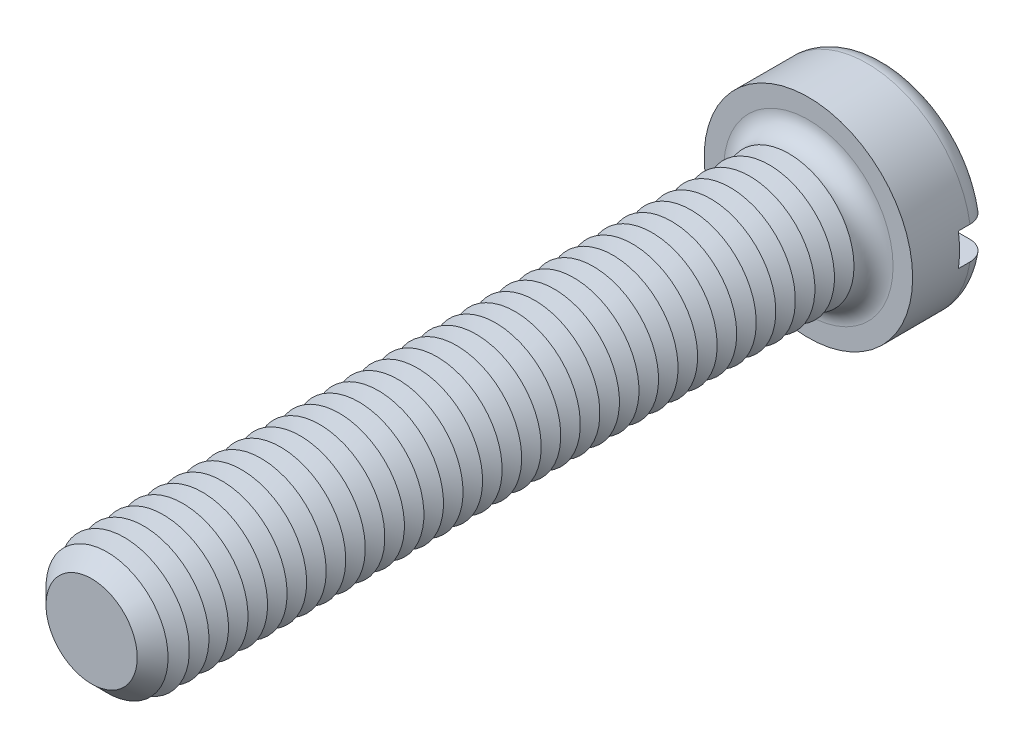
ISO-10303-21;
HEADER;
FILE_DESCRIPTION(('STEP AP214'),'2;1');
FILE_NAME('part.step','',(''),(''),'','','');
FILE_SCHEMA(('AUTOMOTIVE_DESIGN { 1 0 10303 214 1 1 1 1 }'));
ENDSEC;
DATA;
#1=APPLICATION_CONTEXT('core data for automotive mechanical design processes');
#2=APPLICATION_PROTOCOL_DEFINITION('international standard','automotive_design',2000,#1);
#3=PRODUCT_CONTEXT('',#1,'mechanical');
#4=PRODUCT('Part','Part','',(#3));
#5=PRODUCT_RELATED_PRODUCT_CATEGORY('part','',(#4));
#6=PRODUCT_DEFINITION_FORMATION('','',#4);
#7=PRODUCT_DEFINITION_CONTEXT('part definition',#1,'design');
#8=PRODUCT_DEFINITION('design','',#6,#7);
#9=PRODUCT_DEFINITION_SHAPE('','',#8);
#10=(LENGTH_UNIT() NAMED_UNIT(*) SI_UNIT(.MILLI.,.METRE.));
#11=(NAMED_UNIT(*) PLANE_ANGLE_UNIT() SI_UNIT($,.RADIAN.));
#12=(NAMED_UNIT(*) SI_UNIT($,.STERADIAN.) SOLID_ANGLE_UNIT());
#13=UNCERTAINTY_MEASURE_WITH_UNIT(LENGTH_MEASURE(1.E-05),#10,'distance_accuracy_value','');
#14=(GEOMETRIC_REPRESENTATION_CONTEXT(3) GLOBAL_UNCERTAINTY_ASSIGNED_CONTEXT((#13)) GLOBAL_UNIT_ASSIGNED_CONTEXT((#10,
#11,#12)) REPRESENTATION_CONTEXT('',''));
#15=CARTESIAN_POINT('',(0.,0.,0.));
#16=DIRECTION('',(0.,0.,1.));
#17=DIRECTION('',(1.,0.,0.));
#18=AXIS2_PLACEMENT_3D('',#15,#16,#17);
#19=CARTESIAN_POINT('',(0.,0.,-6.));
#20=DIRECTION('',(0.,0.,1.));
#21=DIRECTION('',(1.,0.,0.));
#22=AXIS2_PLACEMENT_3D('',#19,#20,#21);
#23=PLANE('',#22);
#24=CARTESIAN_POINT('',(0.,0.,-6.));
#25=DIRECTION('',(0.,0.,1.));
#26=DIRECTION('',(1.,0.,0.));
#27=AXIS2_PLACEMENT_3D('',#24,#25,#26);
#28=CIRCLE('',#27,6.5);
#29=CARTESIAN_POINT('',(-6.37867541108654,1.25,-6.));
#30=VERTEX_POINT('',#29);
#31=CARTESIAN_POINT('',(6.37867541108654,1.25,-6.));
#32=VERTEX_POINT('',#31);
#33=EDGE_CURVE('E116',#30,#32,#28,.F.);
#34=ORIENTED_EDGE('',*,*,#33,.T.);
#35=DIRECTION('',(1.,0.,0.));
#36=VECTOR('',#35,1.);
#37=CARTESIAN_POINT('',(-8.,1.25,-6.));
#38=LINE('',#37,#36);
#39=EDGE_CURVE('E111',#30,#32,#38,.T.);
#40=ORIENTED_EDGE('',*,*,#39,.F.);
#41=EDGE_LOOP('',(#34,#40));
#42=FACE_BOUND('',#41,.T.);
#43=ADVANCED_FACE('F39',(#42),#23,.F.);
#44=CARTESIAN_POINT('',(0.,0.,-4.5));
#45=DIRECTION('',(0.,0.,1.));
#46=DIRECTION('',(1.,0.,0.));
#47=AXIS2_PLACEMENT_3D('',#44,#45,#46);
#48=TOROIDAL_SURFACE('',#47,6.5,1.5);
#49=CARTESIAN_POINT('',(-7.63778128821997,1.25,-5.34492908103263));
#50=CARTESIAN_POINT('',(-7.58949199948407,1.25,-5.41482553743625));
#51=CARTESIAN_POINT('',(-7.53520056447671,1.25,-5.48065698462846));
#52=CARTESIAN_POINT('',(-7.41624971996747,1.25,-5.60228223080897));
#53=CARTESIAN_POINT('',(-7.35157642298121,1.25,-5.65806236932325));
#54=CARTESIAN_POINT('',(-7.21387612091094,1.25,-5.75795436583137));
#55=CARTESIAN_POINT('',(-7.14085828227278,1.25,-5.80207885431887));
#56=CARTESIAN_POINT('',(-6.98853766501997,1.25,-5.87758013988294));
#57=CARTESIAN_POINT('',(-6.90923642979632,1.25,-5.90896005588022));
#58=CARTESIAN_POINT('',(-6.74565677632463,1.25,-5.95849861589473));
#59=CARTESIAN_POINT('',(-6.66133328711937,1.25,-5.97650838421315));
#60=CARTESIAN_POINT('',(-6.49086565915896,1.25,-5.99833509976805));
#61=CARTESIAN_POINT('',(-6.40472129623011,1.25,-6.00215028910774));
#62=CARTESIAN_POINT('',(-6.23174891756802,1.25,-5.99550457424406));
#63=CARTESIAN_POINT('',(-6.14492874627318,1.25,-5.98483870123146));
#64=CARTESIAN_POINT('',(-5.97427268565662,1.25,-5.94920077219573));
#65=CARTESIAN_POINT('',(-5.89043699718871,1.25,-5.92422775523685));
#66=CARTESIAN_POINT('',(-5.72747580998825,1.25,-5.86041051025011));
#67=CARTESIAN_POINT('',(-5.64839123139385,1.25,-5.8214616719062));
#68=CARTESIAN_POINT('',(-5.49793182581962,1.25,-5.73076137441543));
#69=CARTESIAN_POINT('',(-5.42655700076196,1.25,-5.6790099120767));
#70=CARTESIAN_POINT('',(-5.29410028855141,1.25,-5.56444713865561));
#71=CARTESIAN_POINT('',(-5.23295591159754,1.25,-5.50170815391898));
#72=CARTESIAN_POINT('',(-5.12236155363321,1.25,-5.36664720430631));
#73=CARTESIAN_POINT('',(-5.07291010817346,1.25,-5.29432644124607));
#74=CARTESIAN_POINT('',(-4.98836421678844,1.25,-5.14389152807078));
#75=CARTESIAN_POINT('',(-4.95296843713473,1.25,-5.0659468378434));
#76=CARTESIAN_POINT('',(-4.89620356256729,1.25,-4.90510804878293));
#77=CARTESIAN_POINT('',(-4.87483169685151,1.25,-4.82221493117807));
#78=CARTESIAN_POINT('',(-4.8472995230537,1.25,-4.65636387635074));
#79=CARTESIAN_POINT('',(-4.84072446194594,1.25,-4.57347463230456));
#80=CARTESIAN_POINT('',(-4.84179430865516,1.25,-4.40779255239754));
#81=CARTESIAN_POINT('',(-4.84943782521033,1.25,-4.32499970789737));
#82=CARTESIAN_POINT('',(-4.87846819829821,1.25,-4.16301415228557));
#83=CARTESIAN_POINT('',(-4.89966978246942,1.25,-4.08378809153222));
#84=CARTESIAN_POINT('',(-4.95491528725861,1.25,-3.92995334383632));
#85=CARTESIAN_POINT('',(-4.98895983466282,1.25,-3.85534488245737));
#86=CARTESIAN_POINT('',(-5.06928242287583,1.25,-3.71183790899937));
#87=CARTESIAN_POINT('',(-5.11570495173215,1.25,-3.64302036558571));
#88=CARTESIAN_POINT('',(-5.21915370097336,1.25,-3.51388372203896));
#89=CARTESIAN_POINT('',(-5.27618132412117,1.25,-3.45356574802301));
#90=CARTESIAN_POINT('',(-5.40090076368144,1.25,-3.34137671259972));
#91=CARTESIAN_POINT('',(-5.46884305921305,1.25,-3.28978408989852));
#92=CARTESIAN_POINT('',(-5.61225757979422,1.25,-3.19841811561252));
#93=CARTESIAN_POINT('',(-5.68773079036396,1.25,-3.15864631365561));
#94=CARTESIAN_POINT('',(-5.84602026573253,1.25,-3.09111626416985));
#95=CARTESIAN_POINT('',(-5.92896901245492,1.25,-3.06366820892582));
#96=CARTESIAN_POINT('',(-6.09827849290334,1.25,-3.02294686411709));
#97=CARTESIAN_POINT('',(-6.18463944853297,1.25,-3.00967449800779));
#98=CARTESIAN_POINT('',(-6.35914138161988,1.25,-2.99765063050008));
#99=CARTESIAN_POINT('',(-6.4472913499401,1.25,-2.99902877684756));
#100=CARTESIAN_POINT('',(-6.62209547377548,1.25,-3.01665363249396));
#101=CARTESIAN_POINT('',(-6.70874965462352,1.25,-3.03290008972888));
#102=CARTESIAN_POINT('',(-6.87754008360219,1.25,-3.07975247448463));
#103=CARTESIAN_POINT('',(-6.95969991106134,1.25,-3.11027336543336));
#104=CARTESIAN_POINT('',(-7.11762200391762,1.25,-3.18486653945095));
#105=CARTESIAN_POINT('',(-7.19338469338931,1.25,-3.22893792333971));
#106=CARTESIAN_POINT('',(-7.33522754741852,1.25,-3.32873457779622));
#107=CARTESIAN_POINT('',(-7.40142768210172,1.25,-3.38428930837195));
#108=CARTESIAN_POINT('',(-7.52338344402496,1.25,-3.50587739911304));
#109=CARTESIAN_POINT('',(-7.5791399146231,1.25,-3.57190991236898));
#110=CARTESIAN_POINT('',(-7.67774856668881,1.25,-3.71151097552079));
#111=CARTESIAN_POINT('',(-7.72078137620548,1.25,-3.7849519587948));
#112=CARTESIAN_POINT('',(-7.79373860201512,1.25,-3.93807617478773));
#113=CARTESIAN_POINT('',(-7.82366445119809,1.25,-4.01775872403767));
#114=CARTESIAN_POINT('',(-7.86922494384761,1.25,-4.1801114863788));
#115=CARTESIAN_POINT('',(-7.88502105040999,1.25,-4.26273642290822));
#116=CARTESIAN_POINT('',(-7.90243332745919,1.25,-4.42948977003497));
#117=CARTESIAN_POINT('',(-7.90404643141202,1.25,-4.51361850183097));
#118=CARTESIAN_POINT('',(-7.89306914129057,1.25,-4.68049925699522));
#119=CARTESIAN_POINT('',(-7.88055163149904,1.25,-4.76325613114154));
#120=CARTESIAN_POINT('',(-7.84181179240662,1.25,-4.92542124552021));
#121=CARTESIAN_POINT('',(-7.81560657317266,1.25,-5.00483353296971));
#122=CARTESIAN_POINT('',(-7.76329893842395,1.25,-5.12766777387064));
#123=CARTESIAN_POINT('',(-7.74127773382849,1.25,-5.17287245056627));
#124=CARTESIAN_POINT('',(-7.69279783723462,1.25,-5.26083500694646));
#125=CARTESIAN_POINT('',(-7.66633917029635,1.25,-5.30359290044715));
#126=CARTESIAN_POINT('',(-7.63778128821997,1.25,-5.34492908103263));
#127=B_SPLINE_CURVE_WITH_KNOTS('',3,(#49,#50,#51,#52,#53,#54,#55,#56,#57,#58,#59,#60,#61,#62,
#63,#64,#65,#66,#67,#68,#69,#70,#71,#72,#73,#74,#75,#76,#77,#78,#79,#80,#81,#82,#83,#84,#85,#86,
#87,#88,#89,#90,#91,#92,#93,#94,#95,#96,#97,#98,#99,#100,#101,#102,#103,#104,#105,#106,#107,
#108,#109,#110,#111,#112,#113,#114,#115,#116,#117,#118,#119,#120,#121,#122,#123,#124,#125,#126),
.UNSPECIFIED.,.T.,.F.,(4,2,2,2,2,2,2,2,2,2,2,2,2,2,2,2,2,2,2,2,2,2,2,2,2,2,2,2,2,2,2,2,2,2,2,2,
2,2,4),(0.,0.254678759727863,0.509701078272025,0.764445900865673,1.01912834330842,
1.27660578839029,1.53411511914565,1.7953075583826,2.05651754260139,2.31972495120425,
2.58293242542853,2.84446831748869,3.10597143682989,3.36151874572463,3.61701554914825,
3.86525656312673,4.11347328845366,4.35836855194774,4.60327576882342,4.8511774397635,
5.0991119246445,5.35387584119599,5.60867314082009,5.86956650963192,6.13047687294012,
6.39369803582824,6.65691473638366,6.91858297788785,7.18023385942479,7.43824706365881,
7.69623942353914,7.95037087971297,8.20447454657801,8.45563599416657,8.70685174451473,
8.95677764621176,9.20639187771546,9.35700761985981,9.50762251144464),.UNSPECIFIED.);
#128=CARTESIAN_POINT('',(-7.90174031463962,1.25,-4.50000000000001));
#129=VERTEX_POINT('',#128);
#130=EDGE_CURVE('E464',#129,#30,#127,.T.);
#131=ORIENTED_EDGE('',*,*,#130,.F.);
#132=CARTESIAN_POINT('',(0.,0.,-4.5));
#133=DIRECTION('',(0.,0.,1.));
#134=DIRECTION('',(1.,0.,0.));
#135=AXIS2_PLACEMENT_3D('',#132,#133,#134);
#136=CIRCLE('',#135,8.);
#137=CARTESIAN_POINT('',(7.90174031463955,1.25,-4.5));
#138=VERTEX_POINT('',#137);
#139=EDGE_CURVE('E124',#138,#129,#136,.T.);
#140=ORIENTED_EDGE('',*,*,#139,.F.);
#141=CARTESIAN_POINT('',(4.95236709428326,1.25,-5.05808354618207));
#142=CARTESIAN_POINT('',(4.98477386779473,1.25,-5.13646278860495));
#143=CARTESIAN_POINT('',(5.02397623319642,1.25,-5.21210974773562));
#144=CARTESIAN_POINT('',(5.11464829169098,1.25,-5.35575180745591));
#145=CARTESIAN_POINT('',(5.16613670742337,1.25,-5.42373499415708));
#146=CARTESIAN_POINT('',(5.27963080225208,1.25,-5.55005899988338));
#147=CARTESIAN_POINT('',(5.34161871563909,1.25,-5.60841578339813));
#148=CARTESIAN_POINT('',(5.47431803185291,1.25,-5.71412381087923));
#149=CARTESIAN_POINT('',(5.545027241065,1.25,-5.76147781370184));
#150=CARTESIAN_POINT('',(5.69469818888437,1.25,-5.84486022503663));
#151=CARTESIAN_POINT('',(5.77379661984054,1.25,-5.88064336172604));
#152=CARTESIAN_POINT('',(5.93682776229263,1.25,-5.93863952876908));
#153=CARTESIAN_POINT('',(6.02076112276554,1.25,-5.96085073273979));
#154=CARTESIAN_POINT('',(6.19235911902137,1.25,-5.99130732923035));
#155=CARTESIAN_POINT('',(6.2800597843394,1.25,-5.99935025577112));
#156=CARTESIAN_POINT('',(6.45556807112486,1.25,-6.00057400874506));
#157=CARTESIAN_POINT('',(6.54337569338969,1.25,-5.99375472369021));
#158=CARTESIAN_POINT('',(6.71642471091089,1.25,-5.96539034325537));
#159=CARTESIAN_POINT('',(6.8016703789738,1.25,-5.94387137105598));
#160=CARTESIAN_POINT('',(6.96726399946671,1.25,-5.8866508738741));
#161=CARTESIAN_POINT('',(7.04761223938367,1.25,-5.85095018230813));
#162=CARTESIAN_POINT('',(7.2000703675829,1.25,-5.7668235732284));
#163=CARTESIAN_POINT('',(7.27226868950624,1.25,-5.71855796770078));
#164=CARTESIAN_POINT('',(7.40737382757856,1.25,-5.61041520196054));
#165=CARTESIAN_POINT('',(7.47028138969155,1.25,-5.55053897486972));
#166=CARTESIAN_POINT('',(7.5840004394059,1.25,-5.42185995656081));
#167=CARTESIAN_POINT('',(7.63498189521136,1.25,-5.35320736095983));
#168=CARTESIAN_POINT('',(7.72451646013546,1.25,-5.20822613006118));
#169=CARTESIAN_POINT('',(7.76307051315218,1.25,-5.13189807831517));
#170=CARTESIAN_POINT('',(7.82615156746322,1.25,-4.97479919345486));
#171=CARTESIAN_POINT('',(7.85085353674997,1.25,-4.89409858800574));
#172=CARTESIAN_POINT('',(7.88624162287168,1.25,-4.72968126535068));
#173=CARTESIAN_POINT('',(7.89692844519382,1.25,-4.64596470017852));
#174=CARTESIAN_POINT('',(7.90393395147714,1.25,-4.47857496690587));
#175=CARTESIAN_POINT('',(7.900361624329,1.25,-4.39490633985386));
#176=CARTESIAN_POINT('',(7.8792027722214,1.25,-4.22936201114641));
#177=CARTESIAN_POINT('',(7.86161649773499,1.25,-4.14748627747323));
#178=CARTESIAN_POINT('',(7.81298565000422,1.25,-3.98793539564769));
#179=CARTESIAN_POINT('',(7.78195585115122,1.25,-3.91025574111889));
#180=CARTESIAN_POINT('',(7.70736418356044,1.25,-3.76116938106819));
#181=CARTESIAN_POINT('',(7.66380211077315,1.25,-3.68976277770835));
#182=CARTESIAN_POINT('',(7.56515173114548,1.25,-3.55480889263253));
#183=CARTESIAN_POINT('',(7.51000119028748,1.25,-3.49130712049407));
#184=CARTESIAN_POINT('',(7.38992820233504,1.25,-3.3743390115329));
#185=CARTESIAN_POINT('',(7.32500529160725,1.25,-3.32087315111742));
#186=CARTESIAN_POINT('',(7.18646521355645,1.25,-3.22483712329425));
#187=CARTESIAN_POINT('',(7.11275872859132,1.25,-3.18239583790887));
#188=CARTESIAN_POINT('',(6.95934489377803,1.25,-3.11028530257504));
#189=CARTESIAN_POINT('',(6.87963710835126,1.25,-3.08061698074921));
#190=CARTESIAN_POINT('',(6.71523243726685,1.25,-3.03442872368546));
#191=CARTESIAN_POINT('',(6.63047940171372,1.25,-3.0181086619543));
#192=CARTESIAN_POINT('',(6.45944163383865,1.25,-2.99971307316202));
#193=CARTESIAN_POINT('',(6.37315677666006,1.25,-2.99763871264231));
#194=CARTESIAN_POINT('',(6.20021063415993,1.25,-3.00779604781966));
#195=CARTESIAN_POINT('',(6.11356117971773,1.25,-3.02022976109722));
#196=CARTESIAN_POINT('',(5.94354092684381,1.25,-3.05935975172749));
#197=CARTESIAN_POINT('',(5.86017035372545,1.25,-3.08605700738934));
#198=CARTESIAN_POINT('',(5.69848536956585,1.25,-3.15322746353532));
#199=CARTESIAN_POINT('',(5.62021039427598,1.25,-3.1937956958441));
#200=CARTESIAN_POINT('',(5.47164170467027,1.25,-3.28758816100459));
#201=CARTESIAN_POINT('',(5.40134797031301,1.25,-3.3408123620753));
#202=CARTESIAN_POINT('',(5.27136483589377,1.25,-3.45806317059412));
#203=CARTESIAN_POINT('',(5.21160120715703,1.25,-3.52200740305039));
#204=CARTESIAN_POINT('',(5.10396941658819,1.25,-3.65922833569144));
#205=CARTESIAN_POINT('',(5.05609917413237,1.25,-3.73250340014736));
#206=CARTESIAN_POINT('',(4.97487058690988,1.25,-3.8844714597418));
#207=CARTESIAN_POINT('',(4.94119529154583,1.25,-3.96299495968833));
#208=CARTESIAN_POINT('',(4.88793322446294,1.25,-4.12470694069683));
#209=CARTESIAN_POINT('',(4.86834741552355,1.25,-4.20789574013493));
#210=CARTESIAN_POINT('',(4.84433446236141,1.25,-4.3740749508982));
#211=CARTESIAN_POINT('',(4.83950391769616,1.25,-4.45700748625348));
#212=CARTESIAN_POINT('',(4.84404021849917,1.25,-4.62240731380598));
#213=CARTESIAN_POINT('',(4.85338770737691,1.25,-4.70487508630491));
#214=CARTESIAN_POINT('',(4.87895619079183,1.25,-4.83246978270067));
#215=CARTESIAN_POINT('',(4.89056704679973,1.25,-4.87856970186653));
#216=CARTESIAN_POINT('',(4.91819711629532,1.25,-4.96942661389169));
#217=CARTESIAN_POINT('',(4.93421619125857,1.25,-5.01418364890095));
#218=CARTESIAN_POINT('',(4.95236709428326,1.25,-5.05808354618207));
#219=B_SPLINE_CURVE_WITH_KNOTS('',3,(#141,#142,#143,#144,#145,#146,#147,#148,#149,#150,#151,
#152,#153,#154,#155,#156,#157,#158,#159,#160,#161,#162,#163,#164,#165,#166,#167,#168,#169,#170,
#171,#172,#173,#174,#175,#176,#177,#178,#179,#180,#181,#182,#183,#184,#185,#186,#187,#188,#189,
#190,#191,#192,#193,#194,#195,#196,#197,#198,#199,#200,#201,#202,#203,#204,#205,#206,#207,#208,
#209,#210,#211,#212,#213,#214,#215,#216,#217,#218),.UNSPECIFIED.,.T.,.F.,(4,2,2,2,2,2,2,2,2,2,2,
2,2,2,2,2,2,2,2,2,2,2,2,2,2,2,2,2,2,2,2,2,2,2,2,2,2,2,4),(0.,0.25426396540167,0.508917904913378,
0.763145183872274,1.01730864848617,1.27655188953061,1.53583000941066,1.79878406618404,
2.06174009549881,2.32423003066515,2.5867045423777,2.84598168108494,3.10523799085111,
3.36053725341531,3.61581712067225,3.8677953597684,4.11976091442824,4.36980428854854,
4.61984319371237,4.86960800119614,5.11937687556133,5.37052303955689,5.62168112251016,
5.87565515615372,6.12964764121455,6.38737709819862,6.64512765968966,6.90651052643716,
7.16791132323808,7.43114013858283,7.69436829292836,7.95565940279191,8.21690477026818,
8.47196060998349,8.72703387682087,8.97506819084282,9.22276418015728,9.36518087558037,
9.50759309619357),.UNSPECIFIED.);
#220=EDGE_CURVE('E466',#32,#138,#219,.T.);
#221=ORIENTED_EDGE('',*,*,#220,.F.);
#222=ORIENTED_EDGE('',*,*,#33,.F.);
#223=EDGE_LOOP('',(#131,#140,#221,#222));
#224=FACE_BOUND('',#223,.T.);
#225=ADVANCED_FACE('F448',(#224),#48,.T.);
#226=CARTESIAN_POINT('',(0.,0.,-6.));
#227=DIRECTION('',(0.,0.,1.));
#228=DIRECTION('',(1.,0.,0.));
#229=AXIS2_PLACEMENT_3D('',#226,#227,#228);
#230=CYLINDRICAL_SURFACE('',#229,8.);
#231=DIRECTION('',(0.,0.,1.));
#232=VECTOR('',#231,1.);
#233=CARTESIAN_POINT('',(7.90174031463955,1.25,-6.));
#234=LINE('',#233,#232);
#235=CARTESIAN_POINT('',(7.90174031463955,1.25,-3.6));
#236=VERTEX_POINT('',#235);
#237=EDGE_CURVE('E481',#138,#236,#234,.T.);
#238=ORIENTED_EDGE('',*,*,#237,.F.);
#239=ORIENTED_EDGE('',*,*,#139,.T.);
#240=DIRECTION('',(0.,0.,1.));
#241=VECTOR('',#240,1.);
#242=CARTESIAN_POINT('',(-7.90174031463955,1.25,-6.));
#243=LINE('',#242,#241);
#244=CARTESIAN_POINT('',(-7.90174031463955,1.25,-3.6));
#245=VERTEX_POINT('',#244);
#246=EDGE_CURVE('E63',#245,#129,#243,.F.);
#247=ORIENTED_EDGE('',*,*,#246,.F.);
#248=CARTESIAN_POINT('',(0.,0.,-3.6));
#249=DIRECTION('',(0.,0.,-1.));
#250=DIRECTION('',(-1.,0.,0.));
#251=AXIS2_PLACEMENT_3D('',#248,#249,#250);
#252=CIRCLE('',#251,8.);
#253=CARTESIAN_POINT('',(-7.90174031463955,-1.25,-3.6));
#254=VERTEX_POINT('',#253);
#255=EDGE_CURVE('E43',#245,#254,#252,.F.);
#256=ORIENTED_EDGE('',*,*,#255,.T.);
#257=DIRECTION('',(0.,0.,1.));
#258=VECTOR('',#257,1.);
#259=CARTESIAN_POINT('',(-7.90174031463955,-1.25,-6.));
#260=LINE('',#259,#258);
#261=CARTESIAN_POINT('',(-7.9017403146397,-1.25,-4.49999999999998));
#262=VERTEX_POINT('',#261);
#263=EDGE_CURVE('E478',#262,#254,#260,.T.);
#264=ORIENTED_EDGE('',*,*,#263,.F.);
#265=CARTESIAN_POINT('',(7.90174031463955,-1.25,-4.5));
#266=VERTEX_POINT('',#265);
#267=EDGE_CURVE('E126',#262,#266,#136,.T.);
#268=ORIENTED_EDGE('',*,*,#267,.T.);
#269=DIRECTION('',(0.,0.,1.));
#270=VECTOR('',#269,1.);
#271=CARTESIAN_POINT('',(7.90174031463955,-1.25,-6.));
#272=LINE('',#271,#270);
#273=CARTESIAN_POINT('',(7.90174031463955,-1.25,-3.6));
#274=VERTEX_POINT('',#273);
#275=EDGE_CURVE('E55',#274,#266,#272,.F.);
#276=ORIENTED_EDGE('',*,*,#275,.F.);
#277=EDGE_CURVE('E11',#274,#236,#252,.F.);
#278=ORIENTED_EDGE('',*,*,#277,.T.);
#279=EDGE_LOOP('',(#238,#239,#247,#256,#264,#268,#276,#278));
#280=FACE_BOUND('',#279,.T.);
#281=CARTESIAN_POINT('',(0.,0.,0.));
#282=DIRECTION('',(0.,0.,1.));
#283=DIRECTION('',(1.,0.,0.));
#284=AXIS2_PLACEMENT_3D('',#281,#282,#283);
#285=CIRCLE('',#284,8.);
#286=CARTESIAN_POINT('',(8.,0.,0.));
#287=VERTEX_POINT('',#286);
#288=EDGE_CURVE('E484',#287,#287,#285,.T.);
#289=ORIENTED_EDGE('',*,*,#288,.F.);
#290=EDGE_LOOP('',(#289));
#291=FACE_BOUND('',#290,.T.);
#292=ADVANCED_FACE('F444',(#280,#291),#230,.T.);
#293=CARTESIAN_POINT('',(6.37867541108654,-1.25,-6.));
#294=VERTEX_POINT('',#293);
#295=CARTESIAN_POINT('',(-6.37867541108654,-1.25,-6.));
#296=VERTEX_POINT('',#295);
#297=EDGE_CURVE('E109',#294,#296,#28,.F.);
#298=ORIENTED_EDGE('',*,*,#297,.T.);
#299=DIRECTION('',(-1.,0.,0.));
#300=VECTOR('',#299,1.);
#301=CARTESIAN_POINT('',(-8.,-1.25,-6.));
#302=LINE('',#301,#300);
#303=EDGE_CURVE('E96',#294,#296,#302,.T.);
#304=ORIENTED_EDGE('',*,*,#303,.F.);
#305=EDGE_LOOP('',(#298,#304));
#306=FACE_BOUND('',#305,.T.);
#307=ADVANCED_FACE('F108',(#306),#23,.F.);
#308=CARTESIAN_POINT('',(0.,0.,0.));
#309=DIRECTION('',(0.,0.,1.));
#310=DIRECTION('',(1.,0.,0.));
#311=AXIS2_PLACEMENT_3D('',#308,#309,#310);
#312=PLANE('',#311);
#313=CARTESIAN_POINT('',(0.,0.,0.));
#314=DIRECTION('',(0.,0.,1.));
#315=DIRECTION('',(1.,0.,0.));
#316=AXIS2_PLACEMENT_3D('',#313,#314,#315);
#317=CIRCLE('',#316,6.5);
#318=CARTESIAN_POINT('',(6.5,0.,0.));
#319=VERTEX_POINT('',#318);
#320=EDGE_CURVE('E115',#319,#319,#317,.F.);
#321=ORIENTED_EDGE('',*,*,#320,.T.);
#322=EDGE_LOOP('',(#321));
#323=FACE_BOUND('',#322,.T.);
#324=ORIENTED_EDGE('',*,*,#288,.T.);
#325=EDGE_LOOP('',(#324));
#326=FACE_BOUND('',#325,.T.);
#327=ADVANCED_FACE('F443',(#323,#326),#312,.T.);
#328=CARTESIAN_POINT('',(-7.63778128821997,-1.25,-5.34492908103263));
#329=CARTESIAN_POINT('',(-7.68527581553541,-1.25,-5.27616964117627));
#330=CARTESIAN_POINT('',(-7.72703224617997,-1.25,-5.20337764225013));
#331=CARTESIAN_POINT('',(-7.79778035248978,-1.25,-5.05176511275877));
#332=CARTESIAN_POINT('',(-7.82675823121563,-1.25,-4.97293817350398));
#333=CARTESIAN_POINT('',(-7.87103239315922,-1.25,-4.81153865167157));
#334=CARTESIAN_POINT('',(-7.8863313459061,-1.25,-4.72896680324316));
#335=CARTESIAN_POINT('',(-7.90278562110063,-1.25,-4.56244566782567));
#336=CARTESIAN_POINT('',(-7.90394420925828,-1.25,-4.4784967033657));
#337=CARTESIAN_POINT('',(-7.89211470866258,-1.25,-4.31190980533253));
#338=CARTESIAN_POINT('',(-7.87917806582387,-1.25,-4.22926821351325));
#339=CARTESIAN_POINT('',(-7.8396278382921,-1.25,-4.06732477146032));
#340=CARTESIAN_POINT('',(-7.81301388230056,-1.25,-3.98802301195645));
#341=CARTESIAN_POINT('',(-7.74686575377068,-1.25,-3.83490116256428));
#342=CARTESIAN_POINT('',(-7.70731700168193,-1.25,-3.76108737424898));
#343=CARTESIAN_POINT('',(-7.61647675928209,-1.25,-3.62108231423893));
#344=CARTESIAN_POINT('',(-7.56518496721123,-1.25,-3.55489123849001));
#345=CARTESIAN_POINT('',(-7.45192141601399,-1.25,-3.43145488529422));
#346=CARTESIAN_POINT('',(-7.3898717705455,-1.25,-3.37428109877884));
#347=CARTESIAN_POINT('',(-7.25715883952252,-1.25,-3.27100737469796));
#348=CARTESIAN_POINT('',(-7.18649507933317,-1.25,-3.22490804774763));
#349=CARTESIAN_POINT('',(-7.03760898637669,-1.25,-3.14445316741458));
#350=CARTESIAN_POINT('',(-6.95930204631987,-1.25,-3.1102542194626));
#351=CARTESIAN_POINT('',(-6.79811453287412,-1.25,-3.05526915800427));
#352=CARTESIAN_POINT('',(-6.71523359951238,-1.25,-3.03448410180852));
#353=CARTESIAN_POINT('',(-6.5459165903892,-1.25,-3.006592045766));
#354=CARTESIAN_POINT('',(-6.45944575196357,-1.25,-2.99969602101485));
#355=CARTESIAN_POINT('',(-6.28655568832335,-1.25,-3.00032465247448));
#356=CARTESIAN_POINT('',(-6.20013646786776,-1.25,-3.00785047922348));
#357=CARTESIAN_POINT('',(-6.02865505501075,-1.25,-3.03725742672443));
#358=CARTESIAN_POINT('',(-5.94362352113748,-1.25,-3.05931758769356));
#359=CARTESIAN_POINT('',(-5.77844448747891,-1.25,-3.11735373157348));
#360=CARTESIAN_POINT('',(-5.69829723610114,-1.25,-3.15333042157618));
#361=CARTESIAN_POINT('',(-5.54495924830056,-1.25,-3.23837037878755));
#362=CARTESIAN_POINT('',(-5.47178958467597,-1.25,-3.28747168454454));
#363=CARTESIAN_POINT('',(-5.33486536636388,-1.25,-3.39741183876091));
#364=CARTESIAN_POINT('',(-5.27111040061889,-1.25,-3.45825017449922));
#365=CARTESIAN_POINT('',(-5.15579778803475,-1.25,-3.58914722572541));
#366=CARTESIAN_POINT('',(-5.10409113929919,-1.25,-3.65907455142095));
#367=CARTESIAN_POINT('',(-5.01353659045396,-1.25,-3.8068142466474));
#368=CARTESIAN_POINT('',(-4.97468647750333,-1.25,-3.88462525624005));
#369=CARTESIAN_POINT('',(-4.91208858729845,-1.25,-4.04366636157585));
#370=CARTESIAN_POINT('',(-4.88795969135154,-1.25,-4.12474643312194));
#371=CARTESIAN_POINT('',(-4.85404909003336,-1.25,-4.28985038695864));
#372=CARTESIAN_POINT('',(-4.84426486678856,-1.25,-4.37387374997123));
#373=CARTESIAN_POINT('',(-4.83946276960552,-1.25,-4.54023897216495));
#374=CARTESIAN_POINT('',(-4.8440833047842,-1.25,-4.62257060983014));
#375=CARTESIAN_POINT('',(-4.86713763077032,-1.25,-4.78527148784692));
#376=CARTESIAN_POINT('',(-4.88557092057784,-1.25,-4.86564079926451));
#377=CARTESIAN_POINT('',(-4.9355229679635,-1.25,-5.02189555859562));
#378=CARTESIAN_POINT('',(-4.9669975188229,-1.25,-5.09779517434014));
#379=CARTESIAN_POINT('',(-5.04199393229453,-1.25,-5.24338322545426));
#380=CARTESIAN_POINT('',(-5.0855168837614,-1.25,-5.31307109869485));
#381=CARTESIAN_POINT('',(-5.18427540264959,-1.25,-5.44580979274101));
#382=CARTESIAN_POINT('',(-5.2397318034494,-1.25,-5.50869620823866));
#383=CARTESIAN_POINT('',(-5.36015301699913,-1.25,-5.62458635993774));
#384=CARTESIAN_POINT('',(-5.42511919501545,-1.25,-5.67758867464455));
#385=CARTESIAN_POINT('',(-5.56469412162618,-1.25,-5.7737610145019));
#386=CARTESIAN_POINT('',(-5.6395232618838,-1.25,-5.81661133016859));
#387=CARTESIAN_POINT('',(-5.79521544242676,-1.25,-5.8894110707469));
#388=CARTESIAN_POINT('',(-5.8760791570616,-1.25,-5.91935905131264));
#389=CARTESIAN_POINT('',(-6.04317815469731,-1.25,-5.9660059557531));
#390=CARTESIAN_POINT('',(-6.12948555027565,-1.25,-5.98244700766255));
#391=CARTESIAN_POINT('',(-6.30363462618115,-1.25,-6.00064866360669));
#392=CARTESIAN_POINT('',(-6.39147629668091,-1.25,-6.00240936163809));
#393=CARTESIAN_POINT('',(-6.5664192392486,-1.25,-5.9911248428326));
#394=CARTESIAN_POINT('',(-6.653518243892,-1.25,-5.9780442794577));
#395=CARTESIAN_POINT('',(-6.82426167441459,-1.25,-5.93729204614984));
#396=CARTESIAN_POINT('',(-6.90790538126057,-1.25,-5.90961735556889));
#397=CARTESIAN_POINT('',(-7.06846412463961,-1.25,-5.84071272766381));
#398=CARTESIAN_POINT('',(-7.14543542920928,-1.25,-5.79961377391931));
#399=CARTESIAN_POINT('',(-7.29116896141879,-1.25,-5.70491210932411));
#400=CARTESIAN_POINT('',(-7.35994165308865,-1.25,-5.65132560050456));
#401=CARTESIAN_POINT('',(-7.46362894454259,-1.25,-5.55509815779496));
#402=CARTESIAN_POINT('',(-7.50165191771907,-1.25,-5.51575032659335));
#403=CARTESIAN_POINT('',(-7.57319530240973,-1.25,-5.43315308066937));
#404=CARTESIAN_POINT('',(-7.60671575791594,-1.25,-5.38990370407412));
#405=CARTESIAN_POINT('',(-7.63778128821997,-1.25,-5.34492908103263));
#406=B_SPLINE_CURVE_WITH_KNOTS('',3,(#328,#329,#330,#331,#332,#333,#334,#335,#336,#337,#338,
#339,#340,#341,#342,#343,#344,#345,#346,#347,#348,#349,#350,#351,#352,#353,#354,#355,#356,#357,
#358,#359,#360,#361,#362,#363,#364,#365,#366,#367,#368,#369,#370,#371,#372,#373,#374,#375,#376,
#377,#378,#379,#380,#381,#382,#383,#384,#385,#386,#387,#388,#389,#390,#391,#392,#393,#394,#395,
#396,#397,#398,#399,#400,#401,#402,#403,#404,#405),.UNSPECIFIED.,.T.,.F.,(4,2,2,2,2,2,2,2,2,2,2,
2,2,2,2,2,2,2,2,2,2,2,2,2,2,2,2,2,2,2,2,2,2,2,2,2,2,2,4),(0.,0.250506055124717,
0.501281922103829,0.752008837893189,1.00267784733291,1.25243500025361,1.50219893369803,
1.75224536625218,2.00229822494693,2.25424343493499,2.50620253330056,2.76136198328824,
3.01654154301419,3.27556891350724,3.53461730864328,3.79691797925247,4.05923197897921,
4.32231463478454,4.5853858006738,4.84500678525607,5.10458306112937,5.3571172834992,
5.60960717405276,5.85581050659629,6.10200490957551,6.34737151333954,6.59276029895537,
6.84315522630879,7.09358613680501,7.35108485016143,7.60861238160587,7.87094926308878,
8.13328446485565,8.39624576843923,8.65926152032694,8.91978401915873,9.17997036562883,
9.34382460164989,9.50767723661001),.UNSPECIFIED.);
#407=EDGE_CURVE('E103',#296,#262,#406,.T.);
#408=ORIENTED_EDGE('',*,*,#407,.F.);
#409=ORIENTED_EDGE('',*,*,#297,.F.);
#410=CARTESIAN_POINT('',(4.95236709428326,-1.25,-5.05808354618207));
#411=CARTESIAN_POINT('',(4.92105512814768,-1.25,-4.98233216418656));
#412=CARTESIAN_POINT('',(4.89604361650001,-1.25,-4.90392040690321));
#413=CARTESIAN_POINT('',(4.85951223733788,-1.25,-4.74395758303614));
#414=CARTESIAN_POINT('',(4.8480045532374,-1.25,-4.66240375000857));
#415=CARTESIAN_POINT('',(4.83891469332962,-1.25,-4.49852199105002));
#416=CARTESIAN_POINT('',(4.84133145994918,-1.25,-4.41619412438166));
#417=CARTESIAN_POINT('',(4.8600038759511,-1.25,-4.25314313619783));
#418=CARTESIAN_POINT('',(4.87625705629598,-1.25,-4.17241973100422));
#419=CARTESIAN_POINT('',(4.92196554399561,-1.25,-4.01505032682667));
#420=CARTESIAN_POINT('',(4.95138456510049,-1.25,-3.93839376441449));
#421=CARTESIAN_POINT('',(5.02244158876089,-1.25,-3.79097367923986));
#422=CARTESIAN_POINT('',(5.06408092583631,-1.25,-3.72021080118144));
#423=CARTESIAN_POINT('',(5.15918188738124,-1.25,-3.5851203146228));
#424=CARTESIAN_POINT('',(5.21285223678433,-1.25,-3.5209397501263));
#425=CARTESIAN_POINT('',(5.32993512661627,-1.25,-3.40218700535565));
#426=CARTESIAN_POINT('',(5.39334903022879,-1.25,-3.34761617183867));
#427=CARTESIAN_POINT('',(5.5300552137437,-1.25,-3.24801679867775));
#428=CARTESIAN_POINT('',(5.60357647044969,-1.25,-3.20330242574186));
#429=CARTESIAN_POINT('',(5.75697062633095,-1.25,-3.1265687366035));
#430=CARTESIAN_POINT('',(5.83684424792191,-1.25,-3.09455086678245));
#431=CARTESIAN_POINT('',(6.00239031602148,-1.25,-3.04353393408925));
#432=CARTESIAN_POINT('',(6.08814636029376,-1.25,-3.02480570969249));
#433=CARTESIAN_POINT('',(6.26158564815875,-1.25,-3.00194915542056));
#434=CARTESIAN_POINT('',(6.34926896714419,-1.25,-2.997821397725));
#435=CARTESIAN_POINT('',(6.52441816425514,-1.25,-3.00435236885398));
#436=CARTESIAN_POINT('',(6.61188199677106,-1.25,-3.01506655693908));
#437=CARTESIAN_POINT('',(6.78373130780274,-1.25,-3.05116556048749));
#438=CARTESIAN_POINT('',(6.8681168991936,-1.25,-3.07654983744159));
#439=CARTESIAN_POINT('',(7.03056473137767,-1.25,-3.14105639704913));
#440=CARTESIAN_POINT('',(7.10867812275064,-1.25,-3.18004978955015));
#441=CARTESIAN_POINT('',(7.25711285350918,-1.25,-3.27078804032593));
#442=CARTESIAN_POINT('',(7.327434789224,-1.25,-3.32253192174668));
#443=CARTESIAN_POINT('',(7.45716954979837,-1.25,-3.4364775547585));
#444=CARTESIAN_POINT('',(7.51672925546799,-1.25,-3.49851206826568));
#445=CARTESIAN_POINT('',(7.62440498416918,-1.25,-3.63182557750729));
#446=CARTESIAN_POINT('',(7.67252193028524,-1.25,-3.70310382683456));
#447=CARTESIAN_POINT('',(7.75523498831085,-1.25,-3.8517825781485));
#448=CARTESIAN_POINT('',(7.79001407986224,-1.25,-3.92908131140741));
#449=CARTESIAN_POINT('',(7.84595474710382,-1.25,-4.08845836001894));
#450=CARTESIAN_POINT('',(7.86711715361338,-1.25,-4.1705363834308));
#451=CARTESIAN_POINT('',(7.89503817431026,-1.25,-4.3362768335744));
#452=CARTESIAN_POINT('',(7.90193595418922,-1.25,-4.41991584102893));
#453=CARTESIAN_POINT('',(7.90153623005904,-1.25,-4.58715860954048));
#454=CARTESIAN_POINT('',(7.89423915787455,-1.25,-4.67076237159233));
#455=CARTESIAN_POINT('',(7.86572271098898,-1.25,-4.83525080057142));
#456=CARTESIAN_POINT('',(7.84455307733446,-1.25,-4.91614410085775));
#457=CARTESIAN_POINT('',(7.78897430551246,-1.25,-5.0732444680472));
#458=CARTESIAN_POINT('',(7.75456511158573,-1.25,-5.1494515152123));
#459=CARTESIAN_POINT('',(7.67339923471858,-1.25,-5.29528903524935));
#460=CARTESIAN_POINT('',(7.62660424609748,-1.25,-5.36489817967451));
#461=CARTESIAN_POINT('',(7.52209201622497,-1.25,-5.49536318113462));
#462=CARTESIAN_POINT('',(7.4643743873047,-1.25,-5.55621872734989));
#463=CARTESIAN_POINT('',(7.33909994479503,-1.25,-5.66807257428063));
#464=CARTESIAN_POINT('',(7.27145672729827,-1.25,-5.71897407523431));
#465=CARTESIAN_POINT('',(7.12868060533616,-1.25,-5.80887807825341));
#466=CARTESIAN_POINT('',(7.0535472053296,-1.25,-5.84787979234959));
#467=CARTESIAN_POINT('',(6.89682225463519,-1.25,-5.91345911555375));
#468=CARTESIAN_POINT('',(6.81515596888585,-1.25,-5.93985808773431));
#469=CARTESIAN_POINT('',(6.64858434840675,-1.25,-5.97879449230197));
#470=CARTESIAN_POINT('',(6.56367874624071,-1.25,-5.99133077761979));
#471=CARTESIAN_POINT('',(6.39168259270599,-1.25,-6.00236627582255));
#472=CARTESIAN_POINT('',(6.30457835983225,-1.25,-6.00065255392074));
#473=CARTESIAN_POINT('',(6.13186422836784,-1.25,-5.98278857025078));
#474=CARTESIAN_POINT('',(6.04625438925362,-1.25,-5.96663773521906));
#475=CARTESIAN_POINT('',(5.87802521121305,-1.25,-5.92012173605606));
#476=CARTESIAN_POINT('',(5.79544617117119,-1.25,-5.88961066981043));
#477=CARTESIAN_POINT('',(5.63656223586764,-1.25,-5.81513349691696));
#478=CARTESIAN_POINT('',(5.56025908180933,-1.25,-5.77116367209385));
#479=CARTESIAN_POINT('',(5.4162607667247,-1.25,-5.67098882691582));
#480=CARTESIAN_POINT('',(5.34855795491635,-1.25,-5.61479480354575));
#481=CARTESIAN_POINT('',(5.22382615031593,-1.25,-5.49168804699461));
#482=CARTESIAN_POINT('',(5.16678340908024,-1.25,-5.42478932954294));
#483=CARTESIAN_POINT('',(5.08326589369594,-1.25,-5.3075481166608));
#484=CARTESIAN_POINT('',(5.05313168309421,-1.25,-5.25976959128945));
#485=CARTESIAN_POINT('',(4.99845900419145,-1.25,-5.16110869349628));
#486=CARTESIAN_POINT('',(4.9739204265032,-1.25,-5.11022638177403));
#487=CARTESIAN_POINT('',(4.95236709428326,-1.25,-5.05808354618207));
#488=B_SPLINE_CURVE_WITH_KNOTS('',3,(#410,#411,#412,#413,#414,#415,#416,#417,#418,#419,#420,
#421,#422,#423,#424,#425,#426,#427,#428,#429,#430,#431,#432,#433,#434,#435,#436,#437,#438,#439,
#440,#441,#442,#443,#444,#445,#446,#447,#448,#449,#450,#451,#452,#453,#454,#455,#456,#457,#458,
#459,#460,#461,#462,#463,#464,#465,#466,#467,#468,#469,#470,#471,#472,#473,#474,#475,#476,#477,
#478,#479,#480,#481,#482,#483,#484,#485,#486,#487),.UNSPECIFIED.,.T.,.F.,(4,2,2,2,2,2,2,2,2,2,2,
2,2,2,2,2,2,2,2,2,2,2,2,2,2,2,2,2,2,2,2,2,2,2,2,2,2,2,4),(0.,0.245701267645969,
0.491624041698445,0.737528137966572,0.983388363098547,1.22857510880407,1.47378864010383,
1.72364048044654,1.97352730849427,2.2304941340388,2.48749022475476,2.74958408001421,
3.01168820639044,3.2747743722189,3.53785088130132,3.79850056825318,4.05913029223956,
4.31587819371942,4.57260537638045,4.82567253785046,5.07872425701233,5.32929532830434,
5.57985877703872,5.82952869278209,6.07919966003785,6.32965199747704,6.58011322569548,
6.8329006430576,7.08570479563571,7.3419930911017,7.59830259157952,7.85844887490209,
8.11860548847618,8.38146435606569,8.64439590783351,8.90709189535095,9.16944670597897,
9.33857644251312,9.5077028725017),.UNSPECIFIED.);
#489=EDGE_CURVE('E92',#266,#294,#488,.T.);
#490=ORIENTED_EDGE('',*,*,#489,.F.);
#491=ORIENTED_EDGE('',*,*,#267,.F.);
#492=EDGE_LOOP('',(#408,#409,#490,#491));
#493=FACE_BOUND('',#492,.T.);
#494=ADVANCED_FACE('F113',(#493),#48,.T.);
#495=CARTESIAN_POINT('',(0.,0.,1.5));
#496=DIRECTION('',(0.,0.,1.));
#497=DIRECTION('',(1.,0.,0.));
#498=AXIS2_PLACEMENT_3D('',#495,#496,#497);
#499=TOROIDAL_SURFACE('',#498,6.5,1.5);
#500=ORIENTED_EDGE('',*,*,#320,.F.);
#501=EDGE_LOOP('',(#500));
#502=FACE_BOUND('',#501,.T.);
#503=CARTESIAN_POINT('',(0.,0.,1.5));
#504=DIRECTION('',(0.,0.,-1.));
#505=DIRECTION('',(-1.,0.,0.));
#506=AXIS2_PLACEMENT_3D('',#503,#504,#505);
#507=CIRCLE('',#506,5.);
#508=CARTESIAN_POINT('',(-5.,0.,1.5));
#509=VERTEX_POINT('',#508);
#510=EDGE_CURVE('E488',#509,#509,#507,.T.);
#511=ORIENTED_EDGE('',*,*,#510,.T.);
#512=EDGE_LOOP('',(#511));
#513=FACE_BOUND('',#512,.T.);
#514=ADVANCED_FACE('F436',(#502,#513),#499,.F.);
#515=CARTESIAN_POINT('',(0.,0.,2.25));
#516=DIRECTION('',(0.,0.,-1.));
#517=DIRECTION('',(-1.,0.,0.));
#518=AXIS2_PLACEMENT_3D('',#515,#516,#517);
#519=CONICAL_SURFACE('',#518,3.70096189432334,1.0471975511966);
#520=ORIENTED_EDGE('',*,*,#510,.F.);
#521=EDGE_LOOP('',(#520));
#522=FACE_BOUND('',#521,.T.);
#523=CARTESIAN_POINT('',(0.,0.,2.25));
#524=DIRECTION('',(0.,0.,-1.));
#525=DIRECTION('',(-1.,0.,0.));
#526=AXIS2_PLACEMENT_3D('',#523,#524,#525);
#527=CIRCLE('',#526,3.70096189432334);
#528=CARTESIAN_POINT('',(-3.70096189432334,0.,2.25));
#529=VERTEX_POINT('',#528);
#530=EDGE_CURVE('E494',#529,#529,#527,.T.);
#531=ORIENTED_EDGE('',*,*,#530,.T.);
#532=EDGE_LOOP('',(#531));
#533=FACE_BOUND('',#532,.T.);
#534=ADVANCED_FACE('F432',(#522,#533),#519,.T.);
#535=CARTESIAN_POINT('',(0.,0.,3.));
#536=DIRECTION('',(0.,0.,1.));
#537=DIRECTION('',(1.,0.,0.));
#538=AXIS2_PLACEMENT_3D('',#535,#536,#537);
#539=CONICAL_SURFACE('',#538,5.,1.0471975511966);
#540=ORIENTED_EDGE('',*,*,#530,.F.);
#541=EDGE_LOOP('',(#540));
#542=FACE_BOUND('',#541,.T.);
#543=CARTESIAN_POINT('',(0.,0.,3.));
#544=DIRECTION('',(0.,0.,-1.));
#545=DIRECTION('',(-1.,0.,0.));
#546=AXIS2_PLACEMENT_3D('',#543,#544,#545);
#547=CIRCLE('',#546,5.);
#548=CARTESIAN_POINT('',(-5.,0.,3.));
#549=VERTEX_POINT('',#548);
#550=EDGE_CURVE('E499',#549,#549,#547,.T.);
#551=ORIENTED_EDGE('',*,*,#550,.T.);
#552=EDGE_LOOP('',(#551));
#553=FACE_BOUND('',#552,.T.);
#554=ADVANCED_FACE('F428',(#542,#553),#539,.T.);
#555=CARTESIAN_POINT('',(0.,0.,3.75));
#556=DIRECTION('',(0.,0.,-1.));
#557=DIRECTION('',(-1.,0.,0.));
#558=AXIS2_PLACEMENT_3D('',#555,#556,#557);
#559=CONICAL_SURFACE('',#558,3.70096189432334,1.0471975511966);
#560=ORIENTED_EDGE('',*,*,#550,.F.);
#561=EDGE_LOOP('',(#560));
#562=FACE_BOUND('',#561,.T.);
#563=CARTESIAN_POINT('',(0.,0.,3.75));
#564=DIRECTION('',(0.,0.,-1.));
#565=DIRECTION('',(-1.,0.,0.));
#566=AXIS2_PLACEMENT_3D('',#563,#564,#565);
#567=CIRCLE('',#566,3.70096189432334);
#568=CARTESIAN_POINT('',(-3.70096189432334,0.,3.75));
#569=VERTEX_POINT('',#568);
#570=EDGE_CURVE('E503',#569,#569,#567,.T.);
#571=ORIENTED_EDGE('',*,*,#570,.T.);
#572=EDGE_LOOP('',(#571));
#573=FACE_BOUND('',#572,.T.);
#574=ADVANCED_FACE('F424',(#562,#573),#559,.T.);
#575=CARTESIAN_POINT('',(0.,0.,4.5));
#576=DIRECTION('',(0.,0.,1.));
#577=DIRECTION('',(1.,0.,0.));
#578=AXIS2_PLACEMENT_3D('',#575,#576,#577);
#579=CONICAL_SURFACE('',#578,5.,1.0471975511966);
#580=ORIENTED_EDGE('',*,*,#570,.F.);
#581=EDGE_LOOP('',(#580));
#582=FACE_BOUND('',#581,.T.);
#583=CARTESIAN_POINT('',(0.,0.,4.5));
#584=DIRECTION('',(0.,0.,-1.));
#585=DIRECTION('',(-1.,0.,0.));
#586=AXIS2_PLACEMENT_3D('',#583,#584,#585);
#587=CIRCLE('',#586,5.);
#588=CARTESIAN_POINT('',(-5.,0.,4.5));
#589=VERTEX_POINT('',#588);
#590=EDGE_CURVE('E507',#589,#589,#587,.T.);
#591=ORIENTED_EDGE('',*,*,#590,.T.);
#592=EDGE_LOOP('',(#591));
#593=FACE_BOUND('',#592,.T.);
#594=ADVANCED_FACE('F420',(#582,#593),#579,.T.);
#595=CARTESIAN_POINT('',(0.,0.,5.25));
#596=DIRECTION('',(0.,0.,-1.));
#597=DIRECTION('',(-1.,0.,0.));
#598=AXIS2_PLACEMENT_3D('',#595,#596,#597);
#599=CONICAL_SURFACE('',#598,3.70096189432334,1.0471975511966);
#600=ORIENTED_EDGE('',*,*,#590,.F.);
#601=EDGE_LOOP('',(#600));
#602=FACE_BOUND('',#601,.T.);
#603=CARTESIAN_POINT('',(0.,0.,5.25));
#604=DIRECTION('',(0.,0.,-1.));
#605=DIRECTION('',(-1.,0.,0.));
#606=AXIS2_PLACEMENT_3D('',#603,#604,#605);
#607=CIRCLE('',#606,3.70096189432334);
#608=CARTESIAN_POINT('',(-3.70096189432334,0.,5.25));
#609=VERTEX_POINT('',#608);
#610=EDGE_CURVE('E510',#609,#609,#607,.T.);
#611=ORIENTED_EDGE('',*,*,#610,.T.);
#612=EDGE_LOOP('',(#611));
#613=FACE_BOUND('',#612,.T.);
#614=ADVANCED_FACE('F416',(#602,#613),#599,.T.);
#615=CARTESIAN_POINT('',(0.,0.,6.));
#616=DIRECTION('',(0.,0.,1.));
#617=DIRECTION('',(1.,0.,0.));
#618=AXIS2_PLACEMENT_3D('',#615,#616,#617);
#619=CONICAL_SURFACE('',#618,5.,1.0471975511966);
#620=ORIENTED_EDGE('',*,*,#610,.F.);
#621=EDGE_LOOP('',(#620));
#622=FACE_BOUND('',#621,.T.);
#623=CARTESIAN_POINT('',(0.,0.,6.));
#624=DIRECTION('',(0.,0.,-1.));
#625=DIRECTION('',(-1.,0.,0.));
#626=AXIS2_PLACEMENT_3D('',#623,#624,#625);
#627=CIRCLE('',#626,5.);
#628=CARTESIAN_POINT('',(-5.,0.,6.));
#629=VERTEX_POINT('',#628);
#630=EDGE_CURVE('E513',#629,#629,#627,.T.);
#631=ORIENTED_EDGE('',*,*,#630,.T.);
#632=EDGE_LOOP('',(#631));
#633=FACE_BOUND('',#632,.T.);
#634=ADVANCED_FACE('F412',(#622,#633),#619,.T.);
#635=CARTESIAN_POINT('',(0.,0.,6.75));
#636=DIRECTION('',(0.,0.,-1.));
#637=DIRECTION('',(-1.,0.,0.));
#638=AXIS2_PLACEMENT_3D('',#635,#636,#637);
#639=CONICAL_SURFACE('',#638,3.70096189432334,1.0471975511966);
#640=ORIENTED_EDGE('',*,*,#630,.F.);
#641=EDGE_LOOP('',(#640));
#642=FACE_BOUND('',#641,.T.);
#643=CARTESIAN_POINT('',(0.,0.,6.75));
#644=DIRECTION('',(0.,0.,-1.));
#645=DIRECTION('',(-1.,0.,0.));
#646=AXIS2_PLACEMENT_3D('',#643,#644,#645);
#647=CIRCLE('',#646,3.70096189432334);
#648=CARTESIAN_POINT('',(-3.70096189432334,0.,6.75));
#649=VERTEX_POINT('',#648);
#650=EDGE_CURVE('E517',#649,#649,#647,.T.);
#651=ORIENTED_EDGE('',*,*,#650,.T.);
#652=EDGE_LOOP('',(#651));
#653=FACE_BOUND('',#652,.T.);
#654=ADVANCED_FACE('F408',(#642,#653),#639,.T.);
#655=CARTESIAN_POINT('',(0.,0.,7.5));
#656=DIRECTION('',(0.,0.,1.));
#657=DIRECTION('',(1.,0.,0.));
#658=AXIS2_PLACEMENT_3D('',#655,#656,#657);
#659=CONICAL_SURFACE('',#658,5.,1.0471975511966);
#660=ORIENTED_EDGE('',*,*,#650,.F.);
#661=EDGE_LOOP('',(#660));
#662=FACE_BOUND('',#661,.T.);
#663=CARTESIAN_POINT('',(0.,0.,7.5));
#664=DIRECTION('',(0.,0.,-1.));
#665=DIRECTION('',(-1.,0.,0.));
#666=AXIS2_PLACEMENT_3D('',#663,#664,#665);
#667=CIRCLE('',#666,5.);
#668=CARTESIAN_POINT('',(-5.,0.,7.5));
#669=VERTEX_POINT('',#668);
#670=EDGE_CURVE('E521',#669,#669,#667,.T.);
#671=ORIENTED_EDGE('',*,*,#670,.T.);
#672=EDGE_LOOP('',(#671));
#673=FACE_BOUND('',#672,.T.);
#674=ADVANCED_FACE('F404',(#662,#673),#659,.T.);
#675=CARTESIAN_POINT('',(0.,0.,8.25));
#676=DIRECTION('',(0.,0.,-1.));
#677=DIRECTION('',(-1.,0.,0.));
#678=AXIS2_PLACEMENT_3D('',#675,#676,#677);
#679=CONICAL_SURFACE('',#678,3.70096189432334,1.0471975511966);
#680=ORIENTED_EDGE('',*,*,#670,.F.);
#681=EDGE_LOOP('',(#680));
#682=FACE_BOUND('',#681,.T.);
#683=CARTESIAN_POINT('',(0.,0.,8.25));
#684=DIRECTION('',(0.,0.,-1.));
#685=DIRECTION('',(-1.,0.,0.));
#686=AXIS2_PLACEMENT_3D('',#683,#684,#685);
#687=CIRCLE('',#686,3.70096189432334);
#688=CARTESIAN_POINT('',(-3.70096189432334,0.,8.25));
#689=VERTEX_POINT('',#688);
#690=EDGE_CURVE('E525',#689,#689,#687,.T.);
#691=ORIENTED_EDGE('',*,*,#690,.T.);
#692=EDGE_LOOP('',(#691));
#693=FACE_BOUND('',#692,.T.);
#694=ADVANCED_FACE('F400',(#682,#693),#679,.T.);
#695=CARTESIAN_POINT('',(0.,0.,9.));
#696=DIRECTION('',(0.,0.,1.));
#697=DIRECTION('',(1.,0.,0.));
#698=AXIS2_PLACEMENT_3D('',#695,#696,#697);
#699=CONICAL_SURFACE('',#698,5.,1.0471975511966);
#700=ORIENTED_EDGE('',*,*,#690,.F.);
#701=EDGE_LOOP('',(#700));
#702=FACE_BOUND('',#701,.T.);
#703=CARTESIAN_POINT('',(0.,0.,9.));
#704=DIRECTION('',(0.,0.,-1.));
#705=DIRECTION('',(-1.,0.,0.));
#706=AXIS2_PLACEMENT_3D('',#703,#704,#705);
#707=CIRCLE('',#706,5.);
#708=CARTESIAN_POINT('',(-5.,0.,9.));
#709=VERTEX_POINT('',#708);
#710=EDGE_CURVE('E529',#709,#709,#707,.T.);
#711=ORIENTED_EDGE('',*,*,#710,.T.);
#712=EDGE_LOOP('',(#711));
#713=FACE_BOUND('',#712,.T.);
#714=ADVANCED_FACE('F396',(#702,#713),#699,.T.);
#715=CARTESIAN_POINT('',(0.,0.,9.75));
#716=DIRECTION('',(0.,0.,-1.));
#717=DIRECTION('',(-1.,0.,0.));
#718=AXIS2_PLACEMENT_3D('',#715,#716,#717);
#719=CONICAL_SURFACE('',#718,3.70096189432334,1.0471975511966);
#720=ORIENTED_EDGE('',*,*,#710,.F.);
#721=EDGE_LOOP('',(#720));
#722=FACE_BOUND('',#721,.T.);
#723=CARTESIAN_POINT('',(0.,0.,9.75));
#724=DIRECTION('',(0.,0.,-1.));
#725=DIRECTION('',(-1.,0.,0.));
#726=AXIS2_PLACEMENT_3D('',#723,#724,#725);
#727=CIRCLE('',#726,3.70096189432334);
#728=CARTESIAN_POINT('',(-3.70096189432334,0.,9.75));
#729=VERTEX_POINT('',#728);
#730=EDGE_CURVE('E533',#729,#729,#727,.T.);
#731=ORIENTED_EDGE('',*,*,#730,.T.);
#732=EDGE_LOOP('',(#731));
#733=FACE_BOUND('',#732,.T.);
#734=ADVANCED_FACE('F392',(#722,#733),#719,.T.);
#735=CARTESIAN_POINT('',(0.,0.,10.5));
#736=DIRECTION('',(0.,0.,1.));
#737=DIRECTION('',(1.,0.,0.));
#738=AXIS2_PLACEMENT_3D('',#735,#736,#737);
#739=CONICAL_SURFACE('',#738,5.,1.0471975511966);
#740=ORIENTED_EDGE('',*,*,#730,.F.);
#741=EDGE_LOOP('',(#740));
#742=FACE_BOUND('',#741,.T.);
#743=CARTESIAN_POINT('',(0.,0.,10.5));
#744=DIRECTION('',(0.,0.,-1.));
#745=DIRECTION('',(-1.,0.,0.));
#746=AXIS2_PLACEMENT_3D('',#743,#744,#745);
#747=CIRCLE('',#746,5.);
#748=CARTESIAN_POINT('',(-5.,0.,10.5));
#749=VERTEX_POINT('',#748);
#750=EDGE_CURVE('E537',#749,#749,#747,.T.);
#751=ORIENTED_EDGE('',*,*,#750,.T.);
#752=EDGE_LOOP('',(#751));
#753=FACE_BOUND('',#752,.T.);
#754=ADVANCED_FACE('F388',(#742,#753),#739,.T.);
#755=CARTESIAN_POINT('',(0.,0.,11.25));
#756=DIRECTION('',(0.,0.,-1.));
#757=DIRECTION('',(-1.,0.,0.));
#758=AXIS2_PLACEMENT_3D('',#755,#756,#757);
#759=CONICAL_SURFACE('',#758,3.70096189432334,1.0471975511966);
#760=ORIENTED_EDGE('',*,*,#750,.F.);
#761=EDGE_LOOP('',(#760));
#762=FACE_BOUND('',#761,.T.);
#763=CARTESIAN_POINT('',(0.,0.,11.25));
#764=DIRECTION('',(0.,0.,-1.));
#765=DIRECTION('',(-1.,0.,0.));
#766=AXIS2_PLACEMENT_3D('',#763,#764,#765);
#767=CIRCLE('',#766,3.70096189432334);
#768=CARTESIAN_POINT('',(-3.70096189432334,0.,11.25));
#769=VERTEX_POINT('',#768);
#770=EDGE_CURVE('E541',#769,#769,#767,.T.);
#771=ORIENTED_EDGE('',*,*,#770,.T.);
#772=EDGE_LOOP('',(#771));
#773=FACE_BOUND('',#772,.T.);
#774=ADVANCED_FACE('F384',(#762,#773),#759,.T.);
#775=CARTESIAN_POINT('',(0.,0.,12.));
#776=DIRECTION('',(0.,0.,1.));
#777=DIRECTION('',(1.,0.,0.));
#778=AXIS2_PLACEMENT_3D('',#775,#776,#777);
#779=CONICAL_SURFACE('',#778,5.,1.0471975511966);
#780=ORIENTED_EDGE('',*,*,#770,.F.);
#781=EDGE_LOOP('',(#780));
#782=FACE_BOUND('',#781,.T.);
#783=CARTESIAN_POINT('',(0.,0.,12.));
#784=DIRECTION('',(0.,0.,-1.));
#785=DIRECTION('',(-1.,0.,0.));
#786=AXIS2_PLACEMENT_3D('',#783,#784,#785);
#787=CIRCLE('',#786,5.);
#788=CARTESIAN_POINT('',(-5.,0.,12.));
#789=VERTEX_POINT('',#788);
#790=EDGE_CURVE('E545',#789,#789,#787,.T.);
#791=ORIENTED_EDGE('',*,*,#790,.T.);
#792=EDGE_LOOP('',(#791));
#793=FACE_BOUND('',#792,.T.);
#794=ADVANCED_FACE('F380',(#782,#793),#779,.T.);
#795=CARTESIAN_POINT('',(0.,0.,12.75));
#796=DIRECTION('',(0.,0.,-1.));
#797=DIRECTION('',(-1.,0.,0.));
#798=AXIS2_PLACEMENT_3D('',#795,#796,#797);
#799=CONICAL_SURFACE('',#798,3.70096189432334,1.0471975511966);
#800=ORIENTED_EDGE('',*,*,#790,.F.);
#801=EDGE_LOOP('',(#800));
#802=FACE_BOUND('',#801,.T.);
#803=CARTESIAN_POINT('',(0.,0.,12.75));
#804=DIRECTION('',(0.,0.,-1.));
#805=DIRECTION('',(-1.,0.,0.));
#806=AXIS2_PLACEMENT_3D('',#803,#804,#805);
#807=CIRCLE('',#806,3.70096189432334);
#808=CARTESIAN_POINT('',(-3.70096189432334,0.,12.75));
#809=VERTEX_POINT('',#808);
#810=EDGE_CURVE('E549',#809,#809,#807,.T.);
#811=ORIENTED_EDGE('',*,*,#810,.T.);
#812=EDGE_LOOP('',(#811));
#813=FACE_BOUND('',#812,.T.);
#814=ADVANCED_FACE('F376',(#802,#813),#799,.T.);
#815=CARTESIAN_POINT('',(0.,0.,13.5));
#816=DIRECTION('',(0.,0.,1.));
#817=DIRECTION('',(1.,0.,0.));
#818=AXIS2_PLACEMENT_3D('',#815,#816,#817);
#819=CONICAL_SURFACE('',#818,5.,1.0471975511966);
#820=ORIENTED_EDGE('',*,*,#810,.F.);
#821=EDGE_LOOP('',(#820));
#822=FACE_BOUND('',#821,.T.);
#823=CARTESIAN_POINT('',(0.,0.,13.5));
#824=DIRECTION('',(0.,0.,-1.));
#825=DIRECTION('',(-1.,0.,0.));
#826=AXIS2_PLACEMENT_3D('',#823,#824,#825);
#827=CIRCLE('',#826,5.);
#828=CARTESIAN_POINT('',(-5.,0.,13.5));
#829=VERTEX_POINT('',#828);
#830=EDGE_CURVE('E553',#829,#829,#827,.T.);
#831=ORIENTED_EDGE('',*,*,#830,.T.);
#832=EDGE_LOOP('',(#831));
#833=FACE_BOUND('',#832,.T.);
#834=ADVANCED_FACE('F372',(#822,#833),#819,.T.);
#835=CARTESIAN_POINT('',(0.,0.,14.25));
#836=DIRECTION('',(0.,0.,-1.));
#837=DIRECTION('',(-1.,0.,0.));
#838=AXIS2_PLACEMENT_3D('',#835,#836,#837);
#839=CONICAL_SURFACE('',#838,3.70096189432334,1.0471975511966);
#840=ORIENTED_EDGE('',*,*,#830,.F.);
#841=EDGE_LOOP('',(#840));
#842=FACE_BOUND('',#841,.T.);
#843=CARTESIAN_POINT('',(0.,0.,14.25));
#844=DIRECTION('',(0.,0.,-1.));
#845=DIRECTION('',(-1.,0.,0.));
#846=AXIS2_PLACEMENT_3D('',#843,#844,#845);
#847=CIRCLE('',#846,3.70096189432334);
#848=CARTESIAN_POINT('',(-3.70096189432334,0.,14.25));
#849=VERTEX_POINT('',#848);
#850=EDGE_CURVE('E557',#849,#849,#847,.T.);
#851=ORIENTED_EDGE('',*,*,#850,.T.);
#852=EDGE_LOOP('',(#851));
#853=FACE_BOUND('',#852,.T.);
#854=ADVANCED_FACE('F368',(#842,#853),#839,.T.);
#855=CARTESIAN_POINT('',(0.,0.,15.));
#856=DIRECTION('',(0.,0.,1.));
#857=DIRECTION('',(1.,0.,0.));
#858=AXIS2_PLACEMENT_3D('',#855,#856,#857);
#859=CONICAL_SURFACE('',#858,5.,1.0471975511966);
#860=ORIENTED_EDGE('',*,*,#850,.F.);
#861=EDGE_LOOP('',(#860));
#862=FACE_BOUND('',#861,.T.);
#863=CARTESIAN_POINT('',(0.,0.,15.));
#864=DIRECTION('',(0.,0.,-1.));
#865=DIRECTION('',(-1.,0.,0.));
#866=AXIS2_PLACEMENT_3D('',#863,#864,#865);
#867=CIRCLE('',#866,5.);
#868=CARTESIAN_POINT('',(-5.,0.,15.));
#869=VERTEX_POINT('',#868);
#870=EDGE_CURVE('E561',#869,#869,#867,.T.);
#871=ORIENTED_EDGE('',*,*,#870,.T.);
#872=EDGE_LOOP('',(#871));
#873=FACE_BOUND('',#872,.T.);
#874=ADVANCED_FACE('F364',(#862,#873),#859,.T.);
#875=CARTESIAN_POINT('',(0.,0.,15.75));
#876=DIRECTION('',(0.,0.,-1.));
#877=DIRECTION('',(-1.,0.,0.));
#878=AXIS2_PLACEMENT_3D('',#875,#876,#877);
#879=CONICAL_SURFACE('',#878,3.70096189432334,1.0471975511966);
#880=ORIENTED_EDGE('',*,*,#870,.F.);
#881=EDGE_LOOP('',(#880));
#882=FACE_BOUND('',#881,.T.);
#883=CARTESIAN_POINT('',(0.,0.,15.75));
#884=DIRECTION('',(0.,0.,-1.));
#885=DIRECTION('',(-1.,0.,0.));
#886=AXIS2_PLACEMENT_3D('',#883,#884,#885);
#887=CIRCLE('',#886,3.70096189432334);
#888=CARTESIAN_POINT('',(-3.70096189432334,0.,15.75));
#889=VERTEX_POINT('',#888);
#890=EDGE_CURVE('E565',#889,#889,#887,.T.);
#891=ORIENTED_EDGE('',*,*,#890,.T.);
#892=EDGE_LOOP('',(#891));
#893=FACE_BOUND('',#892,.T.);
#894=ADVANCED_FACE('F360',(#882,#893),#879,.T.);
#895=CARTESIAN_POINT('',(0.,0.,16.5));
#896=DIRECTION('',(0.,0.,1.));
#897=DIRECTION('',(1.,0.,0.));
#898=AXIS2_PLACEMENT_3D('',#895,#896,#897);
#899=CONICAL_SURFACE('',#898,5.,1.0471975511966);
#900=ORIENTED_EDGE('',*,*,#890,.F.);
#901=EDGE_LOOP('',(#900));
#902=FACE_BOUND('',#901,.T.);
#903=CARTESIAN_POINT('',(0.,0.,16.5));
#904=DIRECTION('',(0.,0.,-1.));
#905=DIRECTION('',(-1.,0.,0.));
#906=AXIS2_PLACEMENT_3D('',#903,#904,#905);
#907=CIRCLE('',#906,5.);
#908=CARTESIAN_POINT('',(-5.,0.,16.5));
#909=VERTEX_POINT('',#908);
#910=EDGE_CURVE('E569',#909,#909,#907,.T.);
#911=ORIENTED_EDGE('',*,*,#910,.T.);
#912=EDGE_LOOP('',(#911));
#913=FACE_BOUND('',#912,.T.);
#914=ADVANCED_FACE('F356',(#902,#913),#899,.T.);
#915=CARTESIAN_POINT('',(0.,0.,17.25));
#916=DIRECTION('',(0.,0.,-1.));
#917=DIRECTION('',(-1.,0.,0.));
#918=AXIS2_PLACEMENT_3D('',#915,#916,#917);
#919=CONICAL_SURFACE('',#918,3.70096189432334,1.0471975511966);
#920=ORIENTED_EDGE('',*,*,#910,.F.);
#921=EDGE_LOOP('',(#920));
#922=FACE_BOUND('',#921,.T.);
#923=CARTESIAN_POINT('',(0.,0.,17.25));
#924=DIRECTION('',(0.,0.,-1.));
#925=DIRECTION('',(-1.,0.,0.));
#926=AXIS2_PLACEMENT_3D('',#923,#924,#925);
#927=CIRCLE('',#926,3.70096189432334);
#928=CARTESIAN_POINT('',(-3.70096189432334,0.,17.25));
#929=VERTEX_POINT('',#928);
#930=EDGE_CURVE('E573',#929,#929,#927,.T.);
#931=ORIENTED_EDGE('',*,*,#930,.T.);
#932=EDGE_LOOP('',(#931));
#933=FACE_BOUND('',#932,.T.);
#934=ADVANCED_FACE('F352',(#922,#933),#919,.T.);
#935=CARTESIAN_POINT('',(0.,0.,18.));
#936=DIRECTION('',(0.,0.,1.));
#937=DIRECTION('',(1.,0.,0.));
#938=AXIS2_PLACEMENT_3D('',#935,#936,#937);
#939=CONICAL_SURFACE('',#938,5.,1.0471975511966);
#940=ORIENTED_EDGE('',*,*,#930,.F.);
#941=EDGE_LOOP('',(#940));
#942=FACE_BOUND('',#941,.T.);
#943=CARTESIAN_POINT('',(0.,0.,18.));
#944=DIRECTION('',(0.,0.,-1.));
#945=DIRECTION('',(-1.,0.,0.));
#946=AXIS2_PLACEMENT_3D('',#943,#944,#945);
#947=CIRCLE('',#946,5.);
#948=CARTESIAN_POINT('',(-5.,0.,18.));
#949=VERTEX_POINT('',#948);
#950=EDGE_CURVE('E577',#949,#949,#947,.T.);
#951=ORIENTED_EDGE('',*,*,#950,.T.);
#952=EDGE_LOOP('',(#951));
#953=FACE_BOUND('',#952,.T.);
#954=ADVANCED_FACE('F348',(#942,#953),#939,.T.);
#955=CARTESIAN_POINT('',(0.,0.,18.75));
#956=DIRECTION('',(0.,0.,-1.));
#957=DIRECTION('',(-1.,0.,0.));
#958=AXIS2_PLACEMENT_3D('',#955,#956,#957);
#959=CONICAL_SURFACE('',#958,3.70096189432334,1.0471975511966);
#960=ORIENTED_EDGE('',*,*,#950,.F.);
#961=EDGE_LOOP('',(#960));
#962=FACE_BOUND('',#961,.T.);
#963=CARTESIAN_POINT('',(0.,0.,18.75));
#964=DIRECTION('',(0.,0.,-1.));
#965=DIRECTION('',(-1.,0.,0.));
#966=AXIS2_PLACEMENT_3D('',#963,#964,#965);
#967=CIRCLE('',#966,3.70096189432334);
#968=CARTESIAN_POINT('',(-3.70096189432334,0.,18.75));
#969=VERTEX_POINT('',#968);
#970=EDGE_CURVE('E581',#969,#969,#967,.T.);
#971=ORIENTED_EDGE('',*,*,#970,.T.);
#972=EDGE_LOOP('',(#971));
#973=FACE_BOUND('',#972,.T.);
#974=ADVANCED_FACE('F344',(#962,#973),#959,.T.);
#975=CARTESIAN_POINT('',(0.,0.,19.5));
#976=DIRECTION('',(0.,0.,1.));
#977=DIRECTION('',(1.,0.,0.));
#978=AXIS2_PLACEMENT_3D('',#975,#976,#977);
#979=CONICAL_SURFACE('',#978,5.,1.0471975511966);
#980=ORIENTED_EDGE('',*,*,#970,.F.);
#981=EDGE_LOOP('',(#980));
#982=FACE_BOUND('',#981,.T.);
#983=CARTESIAN_POINT('',(0.,0.,19.5));
#984=DIRECTION('',(0.,0.,-1.));
#985=DIRECTION('',(-1.,0.,0.));
#986=AXIS2_PLACEMENT_3D('',#983,#984,#985);
#987=CIRCLE('',#986,5.);
#988=CARTESIAN_POINT('',(-5.,0.,19.5));
#989=VERTEX_POINT('',#988);
#990=EDGE_CURVE('E585',#989,#989,#987,.T.);
#991=ORIENTED_EDGE('',*,*,#990,.T.);
#992=EDGE_LOOP('',(#991));
#993=FACE_BOUND('',#992,.T.);
#994=ADVANCED_FACE('F340',(#982,#993),#979,.T.);
#995=CARTESIAN_POINT('',(0.,0.,20.25));
#996=DIRECTION('',(0.,0.,-1.));
#997=DIRECTION('',(-1.,0.,0.));
#998=AXIS2_PLACEMENT_3D('',#995,#996,#997);
#999=CONICAL_SURFACE('',#998,3.70096189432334,1.0471975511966);
#1000=ORIENTED_EDGE('',*,*,#990,.F.);
#1001=EDGE_LOOP('',(#1000));
#1002=FACE_BOUND('',#1001,.T.);
#1003=CARTESIAN_POINT('',(0.,0.,20.25));
#1004=DIRECTION('',(0.,0.,-1.));
#1005=DIRECTION('',(-1.,0.,0.));
#1006=AXIS2_PLACEMENT_3D('',#1003,#1004,#1005);
#1007=CIRCLE('',#1006,3.70096189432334);
#1008=CARTESIAN_POINT('',(-3.70096189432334,0.,20.25));
#1009=VERTEX_POINT('',#1008);
#1010=EDGE_CURVE('E589',#1009,#1009,#1007,.T.);
#1011=ORIENTED_EDGE('',*,*,#1010,.T.);
#1012=EDGE_LOOP('',(#1011));
#1013=FACE_BOUND('',#1012,.T.);
#1014=ADVANCED_FACE('F336',(#1002,#1013),#999,.T.);
#1015=CARTESIAN_POINT('',(0.,0.,21.));
#1016=DIRECTION('',(0.,0.,1.));
#1017=DIRECTION('',(1.,0.,0.));
#1018=AXIS2_PLACEMENT_3D('',#1015,#1016,#1017);
#1019=CONICAL_SURFACE('',#1018,5.,1.0471975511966);
#1020=ORIENTED_EDGE('',*,*,#1010,.F.);
#1021=EDGE_LOOP('',(#1020));
#1022=FACE_BOUND('',#1021,.T.);
#1023=CARTESIAN_POINT('',(0.,0.,21.));
#1024=DIRECTION('',(0.,0.,-1.));
#1025=DIRECTION('',(-1.,0.,0.));
#1026=AXIS2_PLACEMENT_3D('',#1023,#1024,#1025);
#1027=CIRCLE('',#1026,5.);
#1028=CARTESIAN_POINT('',(-5.,0.,21.));
#1029=VERTEX_POINT('',#1028);
#1030=EDGE_CURVE('E593',#1029,#1029,#1027,.T.);
#1031=ORIENTED_EDGE('',*,*,#1030,.T.);
#1032=EDGE_LOOP('',(#1031));
#1033=FACE_BOUND('',#1032,.T.);
#1034=ADVANCED_FACE('F332',(#1022,#1033),#1019,.T.);
#1035=CARTESIAN_POINT('',(0.,0.,21.75));
#1036=DIRECTION('',(0.,0.,-1.));
#1037=DIRECTION('',(-1.,0.,0.));
#1038=AXIS2_PLACEMENT_3D('',#1035,#1036,#1037);
#1039=CONICAL_SURFACE('',#1038,3.70096189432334,1.0471975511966);
#1040=ORIENTED_EDGE('',*,*,#1030,.F.);
#1041=EDGE_LOOP('',(#1040));
#1042=FACE_BOUND('',#1041,.T.);
#1043=CARTESIAN_POINT('',(0.,0.,21.75));
#1044=DIRECTION('',(0.,0.,-1.));
#1045=DIRECTION('',(-1.,0.,0.));
#1046=AXIS2_PLACEMENT_3D('',#1043,#1044,#1045);
#1047=CIRCLE('',#1046,3.70096189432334);
#1048=CARTESIAN_POINT('',(-3.70096189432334,0.,21.75));
#1049=VERTEX_POINT('',#1048);
#1050=EDGE_CURVE('E597',#1049,#1049,#1047,.T.);
#1051=ORIENTED_EDGE('',*,*,#1050,.T.);
#1052=EDGE_LOOP('',(#1051));
#1053=FACE_BOUND('',#1052,.T.);
#1054=ADVANCED_FACE('F328',(#1042,#1053),#1039,.T.);
#1055=CARTESIAN_POINT('',(0.,0.,22.5));
#1056=DIRECTION('',(0.,0.,1.));
#1057=DIRECTION('',(1.,0.,0.));
#1058=AXIS2_PLACEMENT_3D('',#1055,#1056,#1057);
#1059=CONICAL_SURFACE('',#1058,5.,1.0471975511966);
#1060=ORIENTED_EDGE('',*,*,#1050,.F.);
#1061=EDGE_LOOP('',(#1060));
#1062=FACE_BOUND('',#1061,.T.);
#1063=CARTESIAN_POINT('',(0.,0.,22.5));
#1064=DIRECTION('',(0.,0.,-1.));
#1065=DIRECTION('',(-1.,0.,0.));
#1066=AXIS2_PLACEMENT_3D('',#1063,#1064,#1065);
#1067=CIRCLE('',#1066,5.);
#1068=CARTESIAN_POINT('',(-5.,0.,22.5));
#1069=VERTEX_POINT('',#1068);
#1070=EDGE_CURVE('E601',#1069,#1069,#1067,.T.);
#1071=ORIENTED_EDGE('',*,*,#1070,.T.);
#1072=EDGE_LOOP('',(#1071));
#1073=FACE_BOUND('',#1072,.T.);
#1074=ADVANCED_FACE('F324',(#1062,#1073),#1059,.T.);
#1075=CARTESIAN_POINT('',(0.,0.,23.25));
#1076=DIRECTION('',(0.,0.,-1.));
#1077=DIRECTION('',(-1.,0.,0.));
#1078=AXIS2_PLACEMENT_3D('',#1075,#1076,#1077);
#1079=CONICAL_SURFACE('',#1078,3.70096189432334,1.0471975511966);
#1080=ORIENTED_EDGE('',*,*,#1070,.F.);
#1081=EDGE_LOOP('',(#1080));
#1082=FACE_BOUND('',#1081,.T.);
#1083=CARTESIAN_POINT('',(0.,0.,23.25));
#1084=DIRECTION('',(0.,0.,-1.));
#1085=DIRECTION('',(-1.,0.,0.));
#1086=AXIS2_PLACEMENT_3D('',#1083,#1084,#1085);
#1087=CIRCLE('',#1086,3.70096189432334);
#1088=CARTESIAN_POINT('',(-3.70096189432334,0.,23.25));
#1089=VERTEX_POINT('',#1088);
#1090=EDGE_CURVE('E605',#1089,#1089,#1087,.T.);
#1091=ORIENTED_EDGE('',*,*,#1090,.T.);
#1092=EDGE_LOOP('',(#1091));
#1093=FACE_BOUND('',#1092,.T.);
#1094=ADVANCED_FACE('F320',(#1082,#1093),#1079,.T.);
#1095=CARTESIAN_POINT('',(0.,0.,24.));
#1096=DIRECTION('',(0.,0.,1.));
#1097=DIRECTION('',(1.,0.,0.));
#1098=AXIS2_PLACEMENT_3D('',#1095,#1096,#1097);
#1099=CONICAL_SURFACE('',#1098,5.,1.0471975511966);
#1100=ORIENTED_EDGE('',*,*,#1090,.F.);
#1101=EDGE_LOOP('',(#1100));
#1102=FACE_BOUND('',#1101,.T.);
#1103=CARTESIAN_POINT('',(0.,0.,24.));
#1104=DIRECTION('',(0.,0.,-1.));
#1105=DIRECTION('',(-1.,0.,0.));
#1106=AXIS2_PLACEMENT_3D('',#1103,#1104,#1105);
#1107=CIRCLE('',#1106,5.);
#1108=CARTESIAN_POINT('',(-5.,0.,24.));
#1109=VERTEX_POINT('',#1108);
#1110=EDGE_CURVE('E609',#1109,#1109,#1107,.T.);
#1111=ORIENTED_EDGE('',*,*,#1110,.T.);
#1112=EDGE_LOOP('',(#1111));
#1113=FACE_BOUND('',#1112,.T.);
#1114=ADVANCED_FACE('F316',(#1102,#1113),#1099,.T.);
#1115=CARTESIAN_POINT('',(0.,0.,24.75));
#1116=DIRECTION('',(0.,0.,-1.));
#1117=DIRECTION('',(-1.,0.,0.));
#1118=AXIS2_PLACEMENT_3D('',#1115,#1116,#1117);
#1119=CONICAL_SURFACE('',#1118,3.70096189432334,1.0471975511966);
#1120=ORIENTED_EDGE('',*,*,#1110,.F.);
#1121=EDGE_LOOP('',(#1120));
#1122=FACE_BOUND('',#1121,.T.);
#1123=CARTESIAN_POINT('',(0.,0.,24.75));
#1124=DIRECTION('',(0.,0.,-1.));
#1125=DIRECTION('',(-1.,0.,0.));
#1126=AXIS2_PLACEMENT_3D('',#1123,#1124,#1125);
#1127=CIRCLE('',#1126,3.70096189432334);
#1128=CARTESIAN_POINT('',(-3.70096189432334,0.,24.75));
#1129=VERTEX_POINT('',#1128);
#1130=EDGE_CURVE('E613',#1129,#1129,#1127,.T.);
#1131=ORIENTED_EDGE('',*,*,#1130,.T.);
#1132=EDGE_LOOP('',(#1131));
#1133=FACE_BOUND('',#1132,.T.);
#1134=ADVANCED_FACE('F312',(#1122,#1133),#1119,.T.);
#1135=CARTESIAN_POINT('',(0.,0.,25.5));
#1136=DIRECTION('',(0.,0.,1.));
#1137=DIRECTION('',(1.,0.,0.));
#1138=AXIS2_PLACEMENT_3D('',#1135,#1136,#1137);
#1139=CONICAL_SURFACE('',#1138,5.,1.0471975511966);
#1140=ORIENTED_EDGE('',*,*,#1130,.F.);
#1141=EDGE_LOOP('',(#1140));
#1142=FACE_BOUND('',#1141,.T.);
#1143=CARTESIAN_POINT('',(0.,0.,25.5));
#1144=DIRECTION('',(0.,0.,-1.));
#1145=DIRECTION('',(-1.,0.,0.));
#1146=AXIS2_PLACEMENT_3D('',#1143,#1144,#1145);
#1147=CIRCLE('',#1146,5.);
#1148=CARTESIAN_POINT('',(-5.,0.,25.5));
#1149=VERTEX_POINT('',#1148);
#1150=EDGE_CURVE('E617',#1149,#1149,#1147,.T.);
#1151=ORIENTED_EDGE('',*,*,#1150,.T.);
#1152=EDGE_LOOP('',(#1151));
#1153=FACE_BOUND('',#1152,.T.);
#1154=ADVANCED_FACE('F308',(#1142,#1153),#1139,.T.);
#1155=CARTESIAN_POINT('',(0.,0.,26.25));
#1156=DIRECTION('',(0.,0.,-1.));
#1157=DIRECTION('',(-1.,0.,0.));
#1158=AXIS2_PLACEMENT_3D('',#1155,#1156,#1157);
#1159=CONICAL_SURFACE('',#1158,3.70096189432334,1.0471975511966);
#1160=ORIENTED_EDGE('',*,*,#1150,.F.);
#1161=EDGE_LOOP('',(#1160));
#1162=FACE_BOUND('',#1161,.T.);
#1163=CARTESIAN_POINT('',(0.,0.,26.25));
#1164=DIRECTION('',(0.,0.,-1.));
#1165=DIRECTION('',(-1.,0.,0.));
#1166=AXIS2_PLACEMENT_3D('',#1163,#1164,#1165);
#1167=CIRCLE('',#1166,3.70096189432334);
#1168=CARTESIAN_POINT('',(-3.70096189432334,0.,26.25));
#1169=VERTEX_POINT('',#1168);
#1170=EDGE_CURVE('E621',#1169,#1169,#1167,.T.);
#1171=ORIENTED_EDGE('',*,*,#1170,.T.);
#1172=EDGE_LOOP('',(#1171));
#1173=FACE_BOUND('',#1172,.T.);
#1174=ADVANCED_FACE('F304',(#1162,#1173),#1159,.T.);
#1175=CARTESIAN_POINT('',(0.,0.,27.));
#1176=DIRECTION('',(0.,0.,1.));
#1177=DIRECTION('',(1.,0.,0.));
#1178=AXIS2_PLACEMENT_3D('',#1175,#1176,#1177);
#1179=CONICAL_SURFACE('',#1178,5.,1.0471975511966);
#1180=ORIENTED_EDGE('',*,*,#1170,.F.);
#1181=EDGE_LOOP('',(#1180));
#1182=FACE_BOUND('',#1181,.T.);
#1183=CARTESIAN_POINT('',(0.,0.,27.));
#1184=DIRECTION('',(0.,0.,-1.));
#1185=DIRECTION('',(-1.,0.,0.));
#1186=AXIS2_PLACEMENT_3D('',#1183,#1184,#1185);
#1187=CIRCLE('',#1186,5.);
#1188=CARTESIAN_POINT('',(-5.,0.,27.));
#1189=VERTEX_POINT('',#1188);
#1190=EDGE_CURVE('E625',#1189,#1189,#1187,.T.);
#1191=ORIENTED_EDGE('',*,*,#1190,.T.);
#1192=EDGE_LOOP('',(#1191));
#1193=FACE_BOUND('',#1192,.T.);
#1194=ADVANCED_FACE('F300',(#1182,#1193),#1179,.T.);
#1195=CARTESIAN_POINT('',(0.,0.,27.75));
#1196=DIRECTION('',(0.,0.,-1.));
#1197=DIRECTION('',(-1.,0.,0.));
#1198=AXIS2_PLACEMENT_3D('',#1195,#1196,#1197);
#1199=CONICAL_SURFACE('',#1198,3.70096189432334,1.0471975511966);
#1200=ORIENTED_EDGE('',*,*,#1190,.F.);
#1201=EDGE_LOOP('',(#1200));
#1202=FACE_BOUND('',#1201,.T.);
#1203=CARTESIAN_POINT('',(0.,0.,27.75));
#1204=DIRECTION('',(0.,0.,-1.));
#1205=DIRECTION('',(-1.,0.,0.));
#1206=AXIS2_PLACEMENT_3D('',#1203,#1204,#1205);
#1207=CIRCLE('',#1206,3.70096189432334);
#1208=CARTESIAN_POINT('',(-3.70096189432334,0.,27.75));
#1209=VERTEX_POINT('',#1208);
#1210=EDGE_CURVE('E629',#1209,#1209,#1207,.T.);
#1211=ORIENTED_EDGE('',*,*,#1210,.T.);
#1212=EDGE_LOOP('',(#1211));
#1213=FACE_BOUND('',#1212,.T.);
#1214=ADVANCED_FACE('F296',(#1202,#1213),#1199,.T.);
#1215=CARTESIAN_POINT('',(0.,0.,28.5));
#1216=DIRECTION('',(0.,0.,1.));
#1217=DIRECTION('',(1.,0.,0.));
#1218=AXIS2_PLACEMENT_3D('',#1215,#1216,#1217);
#1219=CONICAL_SURFACE('',#1218,5.,1.0471975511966);
#1220=ORIENTED_EDGE('',*,*,#1210,.F.);
#1221=EDGE_LOOP('',(#1220));
#1222=FACE_BOUND('',#1221,.T.);
#1223=CARTESIAN_POINT('',(0.,0.,28.5));
#1224=DIRECTION('',(0.,0.,-1.));
#1225=DIRECTION('',(-1.,0.,0.));
#1226=AXIS2_PLACEMENT_3D('',#1223,#1224,#1225);
#1227=CIRCLE('',#1226,5.);
#1228=CARTESIAN_POINT('',(-5.,0.,28.5));
#1229=VERTEX_POINT('',#1228);
#1230=EDGE_CURVE('E633',#1229,#1229,#1227,.T.);
#1231=ORIENTED_EDGE('',*,*,#1230,.T.);
#1232=EDGE_LOOP('',(#1231));
#1233=FACE_BOUND('',#1232,.T.);
#1234=ADVANCED_FACE('F292',(#1222,#1233),#1219,.T.);
#1235=CARTESIAN_POINT('',(0.,0.,29.25));
#1236=DIRECTION('',(0.,0.,-1.));
#1237=DIRECTION('',(-1.,0.,0.));
#1238=AXIS2_PLACEMENT_3D('',#1235,#1236,#1237);
#1239=CONICAL_SURFACE('',#1238,3.70096189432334,1.0471975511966);
#1240=ORIENTED_EDGE('',*,*,#1230,.F.);
#1241=EDGE_LOOP('',(#1240));
#1242=FACE_BOUND('',#1241,.T.);
#1243=CARTESIAN_POINT('',(0.,0.,29.25));
#1244=DIRECTION('',(0.,0.,-1.));
#1245=DIRECTION('',(-1.,0.,0.));
#1246=AXIS2_PLACEMENT_3D('',#1243,#1244,#1245);
#1247=CIRCLE('',#1246,3.70096189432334);
#1248=CARTESIAN_POINT('',(-3.70096189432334,0.,29.25));
#1249=VERTEX_POINT('',#1248);
#1250=EDGE_CURVE('E637',#1249,#1249,#1247,.T.);
#1251=ORIENTED_EDGE('',*,*,#1250,.T.);
#1252=EDGE_LOOP('',(#1251));
#1253=FACE_BOUND('',#1252,.T.);
#1254=ADVANCED_FACE('F288',(#1242,#1253),#1239,.T.);
#1255=CARTESIAN_POINT('',(0.,0.,30.));
#1256=DIRECTION('',(0.,0.,1.));
#1257=DIRECTION('',(1.,0.,0.));
#1258=AXIS2_PLACEMENT_3D('',#1255,#1256,#1257);
#1259=CONICAL_SURFACE('',#1258,5.,1.0471975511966);
#1260=ORIENTED_EDGE('',*,*,#1250,.F.);
#1261=EDGE_LOOP('',(#1260));
#1262=FACE_BOUND('',#1261,.T.);
#1263=CARTESIAN_POINT('',(0.,0.,30.));
#1264=DIRECTION('',(0.,0.,-1.));
#1265=DIRECTION('',(-1.,0.,0.));
#1266=AXIS2_PLACEMENT_3D('',#1263,#1264,#1265);
#1267=CIRCLE('',#1266,5.);
#1268=CARTESIAN_POINT('',(-5.,0.,30.));
#1269=VERTEX_POINT('',#1268);
#1270=EDGE_CURVE('E641',#1269,#1269,#1267,.T.);
#1271=ORIENTED_EDGE('',*,*,#1270,.T.);
#1272=EDGE_LOOP('',(#1271));
#1273=FACE_BOUND('',#1272,.T.);
#1274=ADVANCED_FACE('F284',(#1262,#1273),#1259,.T.);
#1275=CARTESIAN_POINT('',(0.,0.,30.75));
#1276=DIRECTION('',(0.,0.,-1.));
#1277=DIRECTION('',(-1.,0.,0.));
#1278=AXIS2_PLACEMENT_3D('',#1275,#1276,#1277);
#1279=CONICAL_SURFACE('',#1278,3.70096189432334,1.0471975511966);
#1280=ORIENTED_EDGE('',*,*,#1270,.F.);
#1281=EDGE_LOOP('',(#1280));
#1282=FACE_BOUND('',#1281,.T.);
#1283=CARTESIAN_POINT('',(0.,0.,30.75));
#1284=DIRECTION('',(0.,0.,-1.));
#1285=DIRECTION('',(-1.,0.,0.));
#1286=AXIS2_PLACEMENT_3D('',#1283,#1284,#1285);
#1287=CIRCLE('',#1286,3.70096189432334);
#1288=CARTESIAN_POINT('',(-3.70096189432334,0.,30.75));
#1289=VERTEX_POINT('',#1288);
#1290=EDGE_CURVE('E645',#1289,#1289,#1287,.T.);
#1291=ORIENTED_EDGE('',*,*,#1290,.T.);
#1292=EDGE_LOOP('',(#1291));
#1293=FACE_BOUND('',#1292,.T.);
#1294=ADVANCED_FACE('F280',(#1282,#1293),#1279,.T.);
#1295=CARTESIAN_POINT('',(0.,0.,31.5));
#1296=DIRECTION('',(0.,0.,1.));
#1297=DIRECTION('',(1.,0.,0.));
#1298=AXIS2_PLACEMENT_3D('',#1295,#1296,#1297);
#1299=CONICAL_SURFACE('',#1298,5.,1.0471975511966);
#1300=ORIENTED_EDGE('',*,*,#1290,.F.);
#1301=EDGE_LOOP('',(#1300));
#1302=FACE_BOUND('',#1301,.T.);
#1303=CARTESIAN_POINT('',(0.,0.,31.5));
#1304=DIRECTION('',(0.,0.,-1.));
#1305=DIRECTION('',(-1.,0.,0.));
#1306=AXIS2_PLACEMENT_3D('',#1303,#1304,#1305);
#1307=CIRCLE('',#1306,5.);
#1308=CARTESIAN_POINT('',(-5.,0.,31.5));
#1309=VERTEX_POINT('',#1308);
#1310=EDGE_CURVE('E649',#1309,#1309,#1307,.T.);
#1311=ORIENTED_EDGE('',*,*,#1310,.T.);
#1312=EDGE_LOOP('',(#1311));
#1313=FACE_BOUND('',#1312,.T.);
#1314=ADVANCED_FACE('F276',(#1302,#1313),#1299,.T.);
#1315=CARTESIAN_POINT('',(0.,0.,32.25));
#1316=DIRECTION('',(0.,0.,-1.));
#1317=DIRECTION('',(-1.,0.,0.));
#1318=AXIS2_PLACEMENT_3D('',#1315,#1316,#1317);
#1319=CONICAL_SURFACE('',#1318,3.70096189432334,1.0471975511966);
#1320=ORIENTED_EDGE('',*,*,#1310,.F.);
#1321=EDGE_LOOP('',(#1320));
#1322=FACE_BOUND('',#1321,.T.);
#1323=CARTESIAN_POINT('',(0.,0.,32.25));
#1324=DIRECTION('',(0.,0.,-1.));
#1325=DIRECTION('',(-1.,0.,0.));
#1326=AXIS2_PLACEMENT_3D('',#1323,#1324,#1325);
#1327=CIRCLE('',#1326,3.70096189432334);
#1328=CARTESIAN_POINT('',(-3.70096189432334,0.,32.25));
#1329=VERTEX_POINT('',#1328);
#1330=EDGE_CURVE('E653',#1329,#1329,#1327,.T.);
#1331=ORIENTED_EDGE('',*,*,#1330,.T.);
#1332=EDGE_LOOP('',(#1331));
#1333=FACE_BOUND('',#1332,.T.);
#1334=ADVANCED_FACE('F272',(#1322,#1333),#1319,.T.);
#1335=CARTESIAN_POINT('',(0.,0.,33.));
#1336=DIRECTION('',(0.,0.,1.));
#1337=DIRECTION('',(1.,0.,0.));
#1338=AXIS2_PLACEMENT_3D('',#1335,#1336,#1337);
#1339=CONICAL_SURFACE('',#1338,5.,1.0471975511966);
#1340=ORIENTED_EDGE('',*,*,#1330,.F.);
#1341=EDGE_LOOP('',(#1340));
#1342=FACE_BOUND('',#1341,.T.);
#1343=CARTESIAN_POINT('',(0.,0.,33.));
#1344=DIRECTION('',(0.,0.,-1.));
#1345=DIRECTION('',(-1.,0.,0.));
#1346=AXIS2_PLACEMENT_3D('',#1343,#1344,#1345);
#1347=CIRCLE('',#1346,5.);
#1348=CARTESIAN_POINT('',(-5.,0.,33.));
#1349=VERTEX_POINT('',#1348);
#1350=EDGE_CURVE('E657',#1349,#1349,#1347,.T.);
#1351=ORIENTED_EDGE('',*,*,#1350,.T.);
#1352=EDGE_LOOP('',(#1351));
#1353=FACE_BOUND('',#1352,.T.);
#1354=ADVANCED_FACE('F268',(#1342,#1353),#1339,.T.);
#1355=CARTESIAN_POINT('',(0.,0.,33.75));
#1356=DIRECTION('',(0.,0.,-1.));
#1357=DIRECTION('',(-1.,0.,0.));
#1358=AXIS2_PLACEMENT_3D('',#1355,#1356,#1357);
#1359=CONICAL_SURFACE('',#1358,3.70096189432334,1.0471975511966);
#1360=ORIENTED_EDGE('',*,*,#1350,.F.);
#1361=EDGE_LOOP('',(#1360));
#1362=FACE_BOUND('',#1361,.T.);
#1363=CARTESIAN_POINT('',(0.,0.,33.75));
#1364=DIRECTION('',(0.,0.,-1.));
#1365=DIRECTION('',(-1.,0.,0.));
#1366=AXIS2_PLACEMENT_3D('',#1363,#1364,#1365);
#1367=CIRCLE('',#1366,3.70096189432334);
#1368=CARTESIAN_POINT('',(-3.70096189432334,0.,33.75));
#1369=VERTEX_POINT('',#1368);
#1370=EDGE_CURVE('E661',#1369,#1369,#1367,.T.);
#1371=ORIENTED_EDGE('',*,*,#1370,.T.);
#1372=EDGE_LOOP('',(#1371));
#1373=FACE_BOUND('',#1372,.T.);
#1374=ADVANCED_FACE('F264',(#1362,#1373),#1359,.T.);
#1375=CARTESIAN_POINT('',(0.,0.,34.5));
#1376=DIRECTION('',(0.,0.,1.));
#1377=DIRECTION('',(1.,0.,0.));
#1378=AXIS2_PLACEMENT_3D('',#1375,#1376,#1377);
#1379=CONICAL_SURFACE('',#1378,5.,1.0471975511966);
#1380=ORIENTED_EDGE('',*,*,#1370,.F.);
#1381=EDGE_LOOP('',(#1380));
#1382=FACE_BOUND('',#1381,.T.);
#1383=CARTESIAN_POINT('',(0.,0.,34.5));
#1384=DIRECTION('',(0.,0.,-1.));
#1385=DIRECTION('',(-1.,0.,0.));
#1386=AXIS2_PLACEMENT_3D('',#1383,#1384,#1385);
#1387=CIRCLE('',#1386,5.);
#1388=CARTESIAN_POINT('',(-5.,0.,34.5));
#1389=VERTEX_POINT('',#1388);
#1390=EDGE_CURVE('E665',#1389,#1389,#1387,.T.);
#1391=ORIENTED_EDGE('',*,*,#1390,.T.);
#1392=EDGE_LOOP('',(#1391));
#1393=FACE_BOUND('',#1392,.T.);
#1394=ADVANCED_FACE('F260',(#1382,#1393),#1379,.T.);
#1395=CARTESIAN_POINT('',(0.,0.,35.25));
#1396=DIRECTION('',(0.,0.,-1.));
#1397=DIRECTION('',(-1.,0.,0.));
#1398=AXIS2_PLACEMENT_3D('',#1395,#1396,#1397);
#1399=CONICAL_SURFACE('',#1398,3.70096189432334,1.0471975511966);
#1400=ORIENTED_EDGE('',*,*,#1390,.F.);
#1401=EDGE_LOOP('',(#1400));
#1402=FACE_BOUND('',#1401,.T.);
#1403=CARTESIAN_POINT('',(0.,0.,35.25));
#1404=DIRECTION('',(0.,0.,-1.));
#1405=DIRECTION('',(-1.,0.,0.));
#1406=AXIS2_PLACEMENT_3D('',#1403,#1404,#1405);
#1407=CIRCLE('',#1406,3.70096189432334);
#1408=CARTESIAN_POINT('',(-3.70096189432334,0.,35.25));
#1409=VERTEX_POINT('',#1408);
#1410=EDGE_CURVE('E669',#1409,#1409,#1407,.T.);
#1411=ORIENTED_EDGE('',*,*,#1410,.T.);
#1412=EDGE_LOOP('',(#1411));
#1413=FACE_BOUND('',#1412,.T.);
#1414=ADVANCED_FACE('F256',(#1402,#1413),#1399,.T.);
#1415=CARTESIAN_POINT('',(0.,0.,36.));
#1416=DIRECTION('',(0.,0.,1.));
#1417=DIRECTION('',(1.,0.,0.));
#1418=AXIS2_PLACEMENT_3D('',#1415,#1416,#1417);
#1419=CONICAL_SURFACE('',#1418,5.,1.0471975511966);
#1420=ORIENTED_EDGE('',*,*,#1410,.F.);
#1421=EDGE_LOOP('',(#1420));
#1422=FACE_BOUND('',#1421,.T.);
#1423=CARTESIAN_POINT('',(0.,0.,36.));
#1424=DIRECTION('',(0.,0.,-1.));
#1425=DIRECTION('',(-1.,0.,0.));
#1426=AXIS2_PLACEMENT_3D('',#1423,#1424,#1425);
#1427=CIRCLE('',#1426,5.);
#1428=CARTESIAN_POINT('',(-5.,0.,36.));
#1429=VERTEX_POINT('',#1428);
#1430=EDGE_CURVE('E673',#1429,#1429,#1427,.T.);
#1431=ORIENTED_EDGE('',*,*,#1430,.T.);
#1432=EDGE_LOOP('',(#1431));
#1433=FACE_BOUND('',#1432,.T.);
#1434=ADVANCED_FACE('F252',(#1422,#1433),#1419,.T.);
#1435=CARTESIAN_POINT('',(0.,0.,36.75));
#1436=DIRECTION('',(0.,0.,-1.));
#1437=DIRECTION('',(-1.,0.,0.));
#1438=AXIS2_PLACEMENT_3D('',#1435,#1436,#1437);
#1439=CONICAL_SURFACE('',#1438,3.70096189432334,1.0471975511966);
#1440=ORIENTED_EDGE('',*,*,#1430,.F.);
#1441=EDGE_LOOP('',(#1440));
#1442=FACE_BOUND('',#1441,.T.);
#1443=CARTESIAN_POINT('',(0.,0.,36.75));
#1444=DIRECTION('',(0.,0.,-1.));
#1445=DIRECTION('',(-1.,0.,0.));
#1446=AXIS2_PLACEMENT_3D('',#1443,#1444,#1445);
#1447=CIRCLE('',#1446,3.70096189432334);
#1448=CARTESIAN_POINT('',(-3.70096189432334,0.,36.75));
#1449=VERTEX_POINT('',#1448);
#1450=EDGE_CURVE('E677',#1449,#1449,#1447,.T.);
#1451=ORIENTED_EDGE('',*,*,#1450,.T.);
#1452=EDGE_LOOP('',(#1451));
#1453=FACE_BOUND('',#1452,.T.);
#1454=ADVANCED_FACE('F248',(#1442,#1453),#1439,.T.);
#1455=CARTESIAN_POINT('',(0.,0.,37.5));
#1456=DIRECTION('',(0.,0.,1.));
#1457=DIRECTION('',(1.,0.,0.));
#1458=AXIS2_PLACEMENT_3D('',#1455,#1456,#1457);
#1459=CONICAL_SURFACE('',#1458,5.,1.0471975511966);
#1460=ORIENTED_EDGE('',*,*,#1450,.F.);
#1461=EDGE_LOOP('',(#1460));
#1462=FACE_BOUND('',#1461,.T.);
#1463=CARTESIAN_POINT('',(0.,0.,37.5));
#1464=DIRECTION('',(0.,0.,-1.));
#1465=DIRECTION('',(-1.,0.,0.));
#1466=AXIS2_PLACEMENT_3D('',#1463,#1464,#1465);
#1467=CIRCLE('',#1466,5.);
#1468=CARTESIAN_POINT('',(-5.,0.,37.5));
#1469=VERTEX_POINT('',#1468);
#1470=EDGE_CURVE('E681',#1469,#1469,#1467,.T.);
#1471=ORIENTED_EDGE('',*,*,#1470,.T.);
#1472=EDGE_LOOP('',(#1471));
#1473=FACE_BOUND('',#1472,.T.);
#1474=ADVANCED_FACE('F244',(#1462,#1473),#1459,.T.);
#1475=CARTESIAN_POINT('',(0.,0.,38.25));
#1476=DIRECTION('',(0.,0.,-1.));
#1477=DIRECTION('',(-1.,0.,0.));
#1478=AXIS2_PLACEMENT_3D('',#1475,#1476,#1477);
#1479=CONICAL_SURFACE('',#1478,3.70096189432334,1.0471975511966);
#1480=ORIENTED_EDGE('',*,*,#1470,.F.);
#1481=EDGE_LOOP('',(#1480));
#1482=FACE_BOUND('',#1481,.T.);
#1483=CARTESIAN_POINT('',(0.,0.,38.25));
#1484=DIRECTION('',(0.,0.,-1.));
#1485=DIRECTION('',(-1.,0.,0.));
#1486=AXIS2_PLACEMENT_3D('',#1483,#1484,#1485);
#1487=CIRCLE('',#1486,3.70096189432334);
#1488=CARTESIAN_POINT('',(-3.70096189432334,0.,38.25));
#1489=VERTEX_POINT('',#1488);
#1490=EDGE_CURVE('E684',#1489,#1489,#1487,.T.);
#1491=ORIENTED_EDGE('',*,*,#1490,.T.);
#1492=EDGE_LOOP('',(#1491));
#1493=FACE_BOUND('',#1492,.T.);
#1494=ADVANCED_FACE('F240',(#1482,#1493),#1479,.T.);
#1495=CARTESIAN_POINT('',(0.,0.,39.));
#1496=DIRECTION('',(0.,0.,1.));
#1497=DIRECTION('',(1.,0.,0.));
#1498=AXIS2_PLACEMENT_3D('',#1495,#1496,#1497);
#1499=CONICAL_SURFACE('',#1498,5.,1.0471975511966);
#1500=ORIENTED_EDGE('',*,*,#1490,.F.);
#1501=EDGE_LOOP('',(#1500));
#1502=FACE_BOUND('',#1501,.T.);
#1503=CARTESIAN_POINT('',(0.,0.,39.));
#1504=DIRECTION('',(0.,0.,-1.));
#1505=DIRECTION('',(-1.,0.,0.));
#1506=AXIS2_PLACEMENT_3D('',#1503,#1504,#1505);
#1507=CIRCLE('',#1506,5.);
#1508=CARTESIAN_POINT('',(-5.,0.,39.));
#1509=VERTEX_POINT('',#1508);
#1510=EDGE_CURVE('E688',#1509,#1509,#1507,.T.);
#1511=ORIENTED_EDGE('',*,*,#1510,.T.);
#1512=EDGE_LOOP('',(#1511));
#1513=FACE_BOUND('',#1512,.T.);
#1514=ADVANCED_FACE('F236',(#1502,#1513),#1499,.T.);
#1515=CARTESIAN_POINT('',(0.,0.,39.75));
#1516=DIRECTION('',(0.,0.,-1.));
#1517=DIRECTION('',(-1.,0.,0.));
#1518=AXIS2_PLACEMENT_3D('',#1515,#1516,#1517);
#1519=CONICAL_SURFACE('',#1518,3.70096189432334,1.0471975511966);
#1520=ORIENTED_EDGE('',*,*,#1510,.F.);
#1521=EDGE_LOOP('',(#1520));
#1522=FACE_BOUND('',#1521,.T.);
#1523=CARTESIAN_POINT('',(0.,0.,39.75));
#1524=DIRECTION('',(0.,0.,-1.));
#1525=DIRECTION('',(-1.,0.,0.));
#1526=AXIS2_PLACEMENT_3D('',#1523,#1524,#1525);
#1527=CIRCLE('',#1526,3.70096189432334);
#1528=CARTESIAN_POINT('',(-3.70096189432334,0.,39.75));
#1529=VERTEX_POINT('',#1528);
#1530=EDGE_CURVE('E692',#1529,#1529,#1527,.T.);
#1531=ORIENTED_EDGE('',*,*,#1530,.T.);
#1532=EDGE_LOOP('',(#1531));
#1533=FACE_BOUND('',#1532,.T.);
#1534=ADVANCED_FACE('F232',(#1522,#1533),#1519,.T.);
#1535=CARTESIAN_POINT('',(0.,0.,40.5));
#1536=DIRECTION('',(0.,0.,1.));
#1537=DIRECTION('',(1.,0.,0.));
#1538=AXIS2_PLACEMENT_3D('',#1535,#1536,#1537);
#1539=CONICAL_SURFACE('',#1538,5.,1.0471975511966);
#1540=ORIENTED_EDGE('',*,*,#1530,.F.);
#1541=EDGE_LOOP('',(#1540));
#1542=FACE_BOUND('',#1541,.T.);
#1543=CARTESIAN_POINT('',(0.,0.,40.5));
#1544=DIRECTION('',(0.,0.,-1.));
#1545=DIRECTION('',(-1.,0.,0.));
#1546=AXIS2_PLACEMENT_3D('',#1543,#1544,#1545);
#1547=CIRCLE('',#1546,5.);
#1548=CARTESIAN_POINT('',(-5.,0.,40.5));
#1549=VERTEX_POINT('',#1548);
#1550=EDGE_CURVE('E696',#1549,#1549,#1547,.T.);
#1551=ORIENTED_EDGE('',*,*,#1550,.T.);
#1552=EDGE_LOOP('',(#1551));
#1553=FACE_BOUND('',#1552,.T.);
#1554=ADVANCED_FACE('F228',(#1542,#1553),#1539,.T.);
#1555=CARTESIAN_POINT('',(0.,0.,41.25));
#1556=DIRECTION('',(0.,0.,-1.));
#1557=DIRECTION('',(-1.,0.,0.));
#1558=AXIS2_PLACEMENT_3D('',#1555,#1556,#1557);
#1559=CONICAL_SURFACE('',#1558,3.70096189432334,1.0471975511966);
#1560=ORIENTED_EDGE('',*,*,#1550,.F.);
#1561=EDGE_LOOP('',(#1560));
#1562=FACE_BOUND('',#1561,.T.);
#1563=CARTESIAN_POINT('',(0.,0.,41.25));
#1564=DIRECTION('',(0.,0.,-1.));
#1565=DIRECTION('',(-1.,0.,0.));
#1566=AXIS2_PLACEMENT_3D('',#1563,#1564,#1565);
#1567=CIRCLE('',#1566,3.70096189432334);
#1568=CARTESIAN_POINT('',(-3.70096189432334,0.,41.25));
#1569=VERTEX_POINT('',#1568);
#1570=EDGE_CURVE('E699',#1569,#1569,#1567,.T.);
#1571=ORIENTED_EDGE('',*,*,#1570,.T.);
#1572=EDGE_LOOP('',(#1571));
#1573=FACE_BOUND('',#1572,.T.);
#1574=ADVANCED_FACE('F224',(#1562,#1573),#1559,.T.);
#1575=CARTESIAN_POINT('',(0.,0.,42.));
#1576=DIRECTION('',(0.,0.,1.));
#1577=DIRECTION('',(1.,0.,0.));
#1578=AXIS2_PLACEMENT_3D('',#1575,#1576,#1577);
#1579=CONICAL_SURFACE('',#1578,5.,1.0471975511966);
#1580=ORIENTED_EDGE('',*,*,#1570,.F.);
#1581=EDGE_LOOP('',(#1580));
#1582=FACE_BOUND('',#1581,.T.);
#1583=CARTESIAN_POINT('',(0.,0.,42.));
#1584=DIRECTION('',(0.,0.,-1.));
#1585=DIRECTION('',(-1.,0.,0.));
#1586=AXIS2_PLACEMENT_3D('',#1583,#1584,#1585);
#1587=CIRCLE('',#1586,5.);
#1588=CARTESIAN_POINT('',(-5.,0.,42.));
#1589=VERTEX_POINT('',#1588);
#1590=EDGE_CURVE('E703',#1589,#1589,#1587,.T.);
#1591=ORIENTED_EDGE('',*,*,#1590,.T.);
#1592=EDGE_LOOP('',(#1591));
#1593=FACE_BOUND('',#1592,.T.);
#1594=ADVANCED_FACE('F220',(#1582,#1593),#1579,.T.);
#1595=CARTESIAN_POINT('',(0.,0.,42.75));
#1596=DIRECTION('',(0.,0.,-1.));
#1597=DIRECTION('',(-1.,0.,0.));
#1598=AXIS2_PLACEMENT_3D('',#1595,#1596,#1597);
#1599=CONICAL_SURFACE('',#1598,3.70096189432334,1.0471975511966);
#1600=ORIENTED_EDGE('',*,*,#1590,.F.);
#1601=EDGE_LOOP('',(#1600));
#1602=FACE_BOUND('',#1601,.T.);
#1603=CARTESIAN_POINT('',(0.,0.,42.75));
#1604=DIRECTION('',(0.,0.,-1.));
#1605=DIRECTION('',(-1.,0.,0.));
#1606=AXIS2_PLACEMENT_3D('',#1603,#1604,#1605);
#1607=CIRCLE('',#1606,3.70096189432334);
#1608=CARTESIAN_POINT('',(-3.70096189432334,0.,42.75));
#1609=VERTEX_POINT('',#1608);
#1610=EDGE_CURVE('E707',#1609,#1609,#1607,.T.);
#1611=ORIENTED_EDGE('',*,*,#1610,.T.);
#1612=EDGE_LOOP('',(#1611));
#1613=FACE_BOUND('',#1612,.T.);
#1614=ADVANCED_FACE('F216',(#1602,#1613),#1599,.T.);
#1615=CARTESIAN_POINT('',(0.,0.,43.5));
#1616=DIRECTION('',(0.,0.,1.));
#1617=DIRECTION('',(1.,0.,0.));
#1618=AXIS2_PLACEMENT_3D('',#1615,#1616,#1617);
#1619=CONICAL_SURFACE('',#1618,5.,1.0471975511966);
#1620=ORIENTED_EDGE('',*,*,#1610,.F.);
#1621=EDGE_LOOP('',(#1620));
#1622=FACE_BOUND('',#1621,.T.);
#1623=CARTESIAN_POINT('',(0.,0.,43.5));
#1624=DIRECTION('',(0.,0.,-1.));
#1625=DIRECTION('',(-1.,0.,0.));
#1626=AXIS2_PLACEMENT_3D('',#1623,#1624,#1625);
#1627=CIRCLE('',#1626,5.);
#1628=CARTESIAN_POINT('',(-5.,0.,43.5));
#1629=VERTEX_POINT('',#1628);
#1630=EDGE_CURVE('E711',#1629,#1629,#1627,.T.);
#1631=ORIENTED_EDGE('',*,*,#1630,.T.);
#1632=EDGE_LOOP('',(#1631));
#1633=FACE_BOUND('',#1632,.T.);
#1634=ADVANCED_FACE('F212',(#1622,#1633),#1619,.T.);
#1635=CARTESIAN_POINT('',(0.,0.,44.25));
#1636=DIRECTION('',(0.,0.,-1.));
#1637=DIRECTION('',(-1.,0.,0.));
#1638=AXIS2_PLACEMENT_3D('',#1635,#1636,#1637);
#1639=CONICAL_SURFACE('',#1638,3.70096189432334,1.0471975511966);
#1640=ORIENTED_EDGE('',*,*,#1630,.F.);
#1641=EDGE_LOOP('',(#1640));
#1642=FACE_BOUND('',#1641,.T.);
#1643=CARTESIAN_POINT('',(0.,0.,44.25));
#1644=DIRECTION('',(0.,0.,-1.));
#1645=DIRECTION('',(-1.,0.,0.));
#1646=AXIS2_PLACEMENT_3D('',#1643,#1644,#1645);
#1647=CIRCLE('',#1646,3.70096189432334);
#1648=CARTESIAN_POINT('',(-3.70096189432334,0.,44.25));
#1649=VERTEX_POINT('',#1648);
#1650=EDGE_CURVE('E715',#1649,#1649,#1647,.T.);
#1651=ORIENTED_EDGE('',*,*,#1650,.T.);
#1652=EDGE_LOOP('',(#1651));
#1653=FACE_BOUND('',#1652,.T.);
#1654=ADVANCED_FACE('F208',(#1642,#1653),#1639,.T.);
#1655=CARTESIAN_POINT('',(0.,0.,45.));
#1656=DIRECTION('',(0.,0.,1.));
#1657=DIRECTION('',(1.,0.,0.));
#1658=AXIS2_PLACEMENT_3D('',#1655,#1656,#1657);
#1659=CONICAL_SURFACE('',#1658,5.,1.0471975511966);
#1660=ORIENTED_EDGE('',*,*,#1650,.F.);
#1661=EDGE_LOOP('',(#1660));
#1662=FACE_BOUND('',#1661,.T.);
#1663=CARTESIAN_POINT('',(0.,0.,45.));
#1664=DIRECTION('',(0.,0.,-1.));
#1665=DIRECTION('',(-1.,0.,0.));
#1666=AXIS2_PLACEMENT_3D('',#1663,#1664,#1665);
#1667=CIRCLE('',#1666,5.);
#1668=CARTESIAN_POINT('',(-5.,0.,45.));
#1669=VERTEX_POINT('',#1668);
#1670=EDGE_CURVE('E719',#1669,#1669,#1667,.T.);
#1671=ORIENTED_EDGE('',*,*,#1670,.T.);
#1672=EDGE_LOOP('',(#1671));
#1673=FACE_BOUND('',#1672,.T.);
#1674=ADVANCED_FACE('F204',(#1662,#1673),#1659,.T.);
#1675=CARTESIAN_POINT('',(0.,0.,45.75));
#1676=DIRECTION('',(0.,0.,-1.));
#1677=DIRECTION('',(-1.,0.,0.));
#1678=AXIS2_PLACEMENT_3D('',#1675,#1676,#1677);
#1679=CONICAL_SURFACE('',#1678,3.70096189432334,1.0471975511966);
#1680=ORIENTED_EDGE('',*,*,#1670,.F.);
#1681=EDGE_LOOP('',(#1680));
#1682=FACE_BOUND('',#1681,.T.);
#1683=CARTESIAN_POINT('',(0.,0.,45.75));
#1684=DIRECTION('',(0.,0.,-1.));
#1685=DIRECTION('',(-1.,0.,0.));
#1686=AXIS2_PLACEMENT_3D('',#1683,#1684,#1685);
#1687=CIRCLE('',#1686,3.70096189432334);
#1688=CARTESIAN_POINT('',(-3.70096189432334,0.,45.75));
#1689=VERTEX_POINT('',#1688);
#1690=EDGE_CURVE('E723',#1689,#1689,#1687,.T.);
#1691=ORIENTED_EDGE('',*,*,#1690,.T.);
#1692=EDGE_LOOP('',(#1691));
#1693=FACE_BOUND('',#1692,.T.);
#1694=ADVANCED_FACE('F200',(#1682,#1693),#1679,.T.);
#1695=CARTESIAN_POINT('',(0.,0.,46.5));
#1696=DIRECTION('',(0.,0.,1.));
#1697=DIRECTION('',(1.,0.,0.));
#1698=AXIS2_PLACEMENT_3D('',#1695,#1696,#1697);
#1699=CONICAL_SURFACE('',#1698,5.,1.0471975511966);
#1700=ORIENTED_EDGE('',*,*,#1690,.F.);
#1701=EDGE_LOOP('',(#1700));
#1702=FACE_BOUND('',#1701,.T.);
#1703=CARTESIAN_POINT('',(0.,0.,46.5));
#1704=DIRECTION('',(0.,0.,-1.));
#1705=DIRECTION('',(-1.,0.,0.));
#1706=AXIS2_PLACEMENT_3D('',#1703,#1704,#1705);
#1707=CIRCLE('',#1706,5.);
#1708=CARTESIAN_POINT('',(-5.,0.,46.5));
#1709=VERTEX_POINT('',#1708);
#1710=EDGE_CURVE('E727',#1709,#1709,#1707,.T.);
#1711=ORIENTED_EDGE('',*,*,#1710,.T.);
#1712=EDGE_LOOP('',(#1711));
#1713=FACE_BOUND('',#1712,.T.);
#1714=ADVANCED_FACE('F196',(#1702,#1713),#1699,.T.);
#1715=CARTESIAN_POINT('',(0.,0.,47.25));
#1716=DIRECTION('',(0.,0.,-1.));
#1717=DIRECTION('',(-1.,0.,0.));
#1718=AXIS2_PLACEMENT_3D('',#1715,#1716,#1717);
#1719=CONICAL_SURFACE('',#1718,3.70096189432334,1.0471975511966);
#1720=ORIENTED_EDGE('',*,*,#1710,.F.);
#1721=EDGE_LOOP('',(#1720));
#1722=FACE_BOUND('',#1721,.T.);
#1723=CARTESIAN_POINT('',(0.,0.,47.25));
#1724=DIRECTION('',(0.,0.,-1.));
#1725=DIRECTION('',(-1.,0.,0.));
#1726=AXIS2_PLACEMENT_3D('',#1723,#1724,#1725);
#1727=CIRCLE('',#1726,3.70096189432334);
#1728=CARTESIAN_POINT('',(-3.70096189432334,0.,47.25));
#1729=VERTEX_POINT('',#1728);
#1730=EDGE_CURVE('E731',#1729,#1729,#1727,.T.);
#1731=ORIENTED_EDGE('',*,*,#1730,.T.);
#1732=EDGE_LOOP('',(#1731));
#1733=FACE_BOUND('',#1732,.T.);
#1734=ADVANCED_FACE('F192',(#1722,#1733),#1719,.T.);
#1735=CARTESIAN_POINT('',(0.,0.,48.));
#1736=DIRECTION('',(0.,0.,1.));
#1737=DIRECTION('',(1.,0.,0.));
#1738=AXIS2_PLACEMENT_3D('',#1735,#1736,#1737);
#1739=CONICAL_SURFACE('',#1738,5.,1.0471975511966);
#1740=ORIENTED_EDGE('',*,*,#1730,.F.);
#1741=EDGE_LOOP('',(#1740));
#1742=FACE_BOUND('',#1741,.T.);
#1743=CARTESIAN_POINT('',(0.,0.,48.));
#1744=DIRECTION('',(0.,0.,-1.));
#1745=DIRECTION('',(-1.,0.,0.));
#1746=AXIS2_PLACEMENT_3D('',#1743,#1744,#1745);
#1747=CIRCLE('',#1746,5.);
#1748=CARTESIAN_POINT('',(-5.,0.,48.));
#1749=VERTEX_POINT('',#1748);
#1750=EDGE_CURVE('E735',#1749,#1749,#1747,.T.);
#1751=ORIENTED_EDGE('',*,*,#1750,.T.);
#1752=EDGE_LOOP('',(#1751));
#1753=FACE_BOUND('',#1752,.T.);
#1754=ADVANCED_FACE('F188',(#1742,#1753),#1739,.T.);
#1755=CARTESIAN_POINT('',(0.,0.,48.75));
#1756=DIRECTION('',(0.,0.,-1.));
#1757=DIRECTION('',(-1.,0.,0.));
#1758=AXIS2_PLACEMENT_3D('',#1755,#1756,#1757);
#1759=CONICAL_SURFACE('',#1758,3.70096189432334,1.0471975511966);
#1760=ORIENTED_EDGE('',*,*,#1750,.F.);
#1761=EDGE_LOOP('',(#1760));
#1762=FACE_BOUND('',#1761,.T.);
#1763=CARTESIAN_POINT('',(0.,0.,48.75));
#1764=DIRECTION('',(0.,0.,-1.));
#1765=DIRECTION('',(-1.,0.,0.));
#1766=AXIS2_PLACEMENT_3D('',#1763,#1764,#1765);
#1767=CIRCLE('',#1766,3.70096189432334);
#1768=CARTESIAN_POINT('',(-3.70096189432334,0.,48.75));
#1769=VERTEX_POINT('',#1768);
#1770=EDGE_CURVE('E739',#1769,#1769,#1767,.T.);
#1771=ORIENTED_EDGE('',*,*,#1770,.T.);
#1772=EDGE_LOOP('',(#1771));
#1773=FACE_BOUND('',#1772,.T.);
#1774=ADVANCED_FACE('F184',(#1762,#1773),#1759,.T.);
#1775=CARTESIAN_POINT('',(0.,0.,49.5));
#1776=DIRECTION('',(0.,0.,1.));
#1777=DIRECTION('',(1.,0.,0.));
#1778=AXIS2_PLACEMENT_3D('',#1775,#1776,#1777);
#1779=CONICAL_SURFACE('',#1778,5.,1.0471975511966);
#1780=ORIENTED_EDGE('',*,*,#1770,.F.);
#1781=EDGE_LOOP('',(#1780));
#1782=FACE_BOUND('',#1781,.T.);
#1783=CARTESIAN_POINT('',(0.,0.,49.5));
#1784=DIRECTION('',(0.,0.,-1.));
#1785=DIRECTION('',(-1.,0.,0.));
#1786=AXIS2_PLACEMENT_3D('',#1783,#1784,#1785);
#1787=CIRCLE('',#1786,5.);
#1788=CARTESIAN_POINT('',(-5.,0.,49.5));
#1789=VERTEX_POINT('',#1788);
#1790=EDGE_CURVE('E743',#1789,#1789,#1787,.T.);
#1791=ORIENTED_EDGE('',*,*,#1790,.T.);
#1792=EDGE_LOOP('',(#1791));
#1793=FACE_BOUND('',#1792,.T.);
#1794=ADVANCED_FACE('F180',(#1782,#1793),#1779,.T.);
#1795=CARTESIAN_POINT('',(0.,0.,50.25));
#1796=DIRECTION('',(0.,0.,-1.));
#1797=DIRECTION('',(-1.,0.,0.));
#1798=AXIS2_PLACEMENT_3D('',#1795,#1796,#1797);
#1799=CONICAL_SURFACE('',#1798,3.70096189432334,1.0471975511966);
#1800=ORIENTED_EDGE('',*,*,#1790,.F.);
#1801=EDGE_LOOP('',(#1800));
#1802=FACE_BOUND('',#1801,.T.);
#1803=CARTESIAN_POINT('',(0.,0.,50.25));
#1804=DIRECTION('',(0.,0.,-1.));
#1805=DIRECTION('',(-1.,0.,0.));
#1806=AXIS2_PLACEMENT_3D('',#1803,#1804,#1805);
#1807=CIRCLE('',#1806,3.70096189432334);
#1808=CARTESIAN_POINT('',(-3.70096189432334,0.,50.25));
#1809=VERTEX_POINT('',#1808);
#1810=EDGE_CURVE('E747',#1809,#1809,#1807,.T.);
#1811=ORIENTED_EDGE('',*,*,#1810,.T.);
#1812=EDGE_LOOP('',(#1811));
#1813=FACE_BOUND('',#1812,.T.);
#1814=ADVANCED_FACE('F176',(#1802,#1813),#1799,.T.);
#1815=CARTESIAN_POINT('',(0.,0.,51.));
#1816=DIRECTION('',(0.,0.,1.));
#1817=DIRECTION('',(1.,0.,0.));
#1818=AXIS2_PLACEMENT_3D('',#1815,#1816,#1817);
#1819=CONICAL_SURFACE('',#1818,5.,1.0471975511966);
#1820=ORIENTED_EDGE('',*,*,#1810,.F.);
#1821=EDGE_LOOP('',(#1820));
#1822=FACE_BOUND('',#1821,.T.);
#1823=CARTESIAN_POINT('',(0.,0.,51.));
#1824=DIRECTION('',(0.,0.,-1.));
#1825=DIRECTION('',(-1.,0.,0.));
#1826=AXIS2_PLACEMENT_3D('',#1823,#1824,#1825);
#1827=CIRCLE('',#1826,5.);
#1828=CARTESIAN_POINT('',(-5.,0.,51.));
#1829=VERTEX_POINT('',#1828);
#1830=EDGE_CURVE('E751',#1829,#1829,#1827,.T.);
#1831=ORIENTED_EDGE('',*,*,#1830,.T.);
#1832=EDGE_LOOP('',(#1831));
#1833=FACE_BOUND('',#1832,.T.);
#1834=ADVANCED_FACE('F172',(#1822,#1833),#1819,.T.);
#1835=CARTESIAN_POINT('',(0.,0.,51.75));
#1836=DIRECTION('',(0.,0.,-1.));
#1837=DIRECTION('',(-1.,0.,0.));
#1838=AXIS2_PLACEMENT_3D('',#1835,#1836,#1837);
#1839=CONICAL_SURFACE('',#1838,3.70096189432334,1.0471975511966);
#1840=ORIENTED_EDGE('',*,*,#1830,.F.);
#1841=EDGE_LOOP('',(#1840));
#1842=FACE_BOUND('',#1841,.T.);
#1843=CARTESIAN_POINT('',(0.,0.,51.75));
#1844=DIRECTION('',(0.,0.,-1.));
#1845=DIRECTION('',(-1.,0.,0.));
#1846=AXIS2_PLACEMENT_3D('',#1843,#1844,#1845);
#1847=CIRCLE('',#1846,3.70096189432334);
#1848=CARTESIAN_POINT('',(-3.70096189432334,0.,51.75));
#1849=VERTEX_POINT('',#1848);
#1850=EDGE_CURVE('E135',#1849,#1849,#1847,.T.);
#1851=ORIENTED_EDGE('',*,*,#1850,.T.);
#1852=EDGE_LOOP('',(#1851));
#1853=FACE_BOUND('',#1852,.T.);
#1854=ADVANCED_FACE('F168',(#1842,#1853),#1839,.T.);
#1855=CARTESIAN_POINT('',(0.,0.,52.5));
#1856=DIRECTION('',(0.,0.,1.));
#1857=DIRECTION('',(1.,0.,0.));
#1858=AXIS2_PLACEMENT_3D('',#1855,#1856,#1857);
#1859=CONICAL_SURFACE('',#1858,5.,1.0471975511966);
#1860=ORIENTED_EDGE('',*,*,#1850,.F.);
#1861=EDGE_LOOP('',(#1860));
#1862=FACE_BOUND('',#1861,.T.);
#1863=CARTESIAN_POINT('',(0.,0.,52.5));
#1864=DIRECTION('',(0.,0.,-1.));
#1865=DIRECTION('',(-1.,0.,0.));
#1866=AXIS2_PLACEMENT_3D('',#1863,#1864,#1865);
#1867=CIRCLE('',#1866,5.);
#1868=CARTESIAN_POINT('',(-5.,0.,52.5));
#1869=VERTEX_POINT('',#1868);
#1870=EDGE_CURVE('E136',#1869,#1869,#1867,.T.);
#1871=ORIENTED_EDGE('',*,*,#1870,.T.);
#1872=EDGE_LOOP('',(#1871));
#1873=FACE_BOUND('',#1872,.T.);
#1874=ADVANCED_FACE('F164',(#1862,#1873),#1859,.T.);
#1875=CARTESIAN_POINT('',(0.,0.,53.25));
#1876=DIRECTION('',(0.,0.,-1.));
#1877=DIRECTION('',(-1.,0.,0.));
#1878=AXIS2_PLACEMENT_3D('',#1875,#1876,#1877);
#1879=CONICAL_SURFACE('',#1878,3.70096189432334,1.0471975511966);
#1880=ORIENTED_EDGE('',*,*,#1870,.F.);
#1881=EDGE_LOOP('',(#1880));
#1882=FACE_BOUND('',#1881,.T.);
#1883=CARTESIAN_POINT('',(0.,0.,53.25));
#1884=DIRECTION('',(0.,0.,-1.));
#1885=DIRECTION('',(-1.,0.,0.));
#1886=AXIS2_PLACEMENT_3D('',#1883,#1884,#1885);
#1887=CIRCLE('',#1886,3.70096189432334);
#1888=CARTESIAN_POINT('',(-3.70096189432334,0.,53.25));
#1889=VERTEX_POINT('',#1888);
#1890=EDGE_CURVE('E761',#1889,#1889,#1887,.T.);
#1891=ORIENTED_EDGE('',*,*,#1890,.T.);
#1892=EDGE_LOOP('',(#1891));
#1893=FACE_BOUND('',#1892,.T.);
#1894=ADVANCED_FACE('F160',(#1882,#1893),#1879,.T.);
#1895=CARTESIAN_POINT('',(0.,0.,54.));
#1896=DIRECTION('',(0.,0.,1.));
#1897=DIRECTION('',(1.,0.,0.));
#1898=AXIS2_PLACEMENT_3D('',#1895,#1896,#1897);
#1899=CONICAL_SURFACE('',#1898,5.,1.0471975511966);
#1900=CARTESIAN_POINT('',(0.,0.,53.8169872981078));
#1901=DIRECTION('',(0.,0.,1.));
#1902=DIRECTION('',(1.,0.,0.));
#1903=AXIS2_PLACEMENT_3D('',#1900,#1901,#1902);
#1904=CIRCLE('',#1903,4.68301270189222);
#1905=CARTESIAN_POINT('',(4.68301270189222,0.,53.8169872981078));
#1906=VERTEX_POINT('',#1905);
#1907=EDGE_CURVE('E132',#1906,#1906,#1904,.F.);
#1908=ORIENTED_EDGE('',*,*,#1907,.T.);
#1909=EDGE_LOOP('',(#1908));
#1910=FACE_BOUND('',#1909,.T.);
#1911=ORIENTED_EDGE('',*,*,#1890,.F.);
#1912=EDGE_LOOP('',(#1911));
#1913=FACE_BOUND('',#1912,.T.);
#1914=ADVANCED_FACE('F155',(#1910,#1913),#1899,.T.);
#1915=CARTESIAN_POINT('',(0.,0.,55.));
#1916=DIRECTION('',(0.,0.,1.));
#1917=DIRECTION('',(1.,0.,0.));
#1918=AXIS2_PLACEMENT_3D('',#1915,#1916,#1917);
#1919=PLANE('',#1918);
#1920=CARTESIAN_POINT('',(0.,0.,55.));
#1921=DIRECTION('',(0.,0.,1.));
#1922=DIRECTION('',(1.,0.,0.));
#1923=AXIS2_PLACEMENT_3D('',#1920,#1921,#1922);
#1924=CIRCLE('',#1923,3.50000000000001);
#1925=CARTESIAN_POINT('',(3.50000000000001,0.,55.));
#1926=VERTEX_POINT('',#1925);
#1927=EDGE_CURVE('E104',#1926,#1926,#1924,.T.);
#1928=ORIENTED_EDGE('',*,*,#1927,.T.);
#1929=EDGE_LOOP('',(#1928));
#1930=FACE_BOUND('',#1929,.T.);
#1931=ADVANCED_FACE('F159',(#1930),#1919,.T.);
#1932=CARTESIAN_POINT('',(0.,0.,55.));
#1933=DIRECTION('',(0.,0.,-1.));
#1934=DIRECTION('',(-1.,0.,0.));
#1935=AXIS2_PLACEMENT_3D('',#1932,#1933,#1934);
#1936=CONICAL_SURFACE('',#1935,3.50000000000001,0.785398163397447);
#1937=ORIENTED_EDGE('',*,*,#1907,.F.);
#1938=EDGE_LOOP('',(#1937));
#1939=FACE_BOUND('',#1938,.T.);
#1940=ORIENTED_EDGE('',*,*,#1927,.F.);
#1941=EDGE_LOOP('',(#1940));
#1942=FACE_BOUND('',#1941,.T.);
#1943=ADVANCED_FACE('F41',(#1939,#1942),#1936,.T.);
#1944=CARTESIAN_POINT('',(-8.,1.25,-3.6));
#1945=DIRECTION('',(0.,1.,0.));
#1946=DIRECTION('',(-1.,0.,0.));
#1947=AXIS2_PLACEMENT_3D('',#1944,#1945,#1946);
#1948=PLANE('',#1947);
#1949=ORIENTED_EDGE('',*,*,#246,.T.);
#1950=ORIENTED_EDGE('',*,*,#130,.T.);
#1951=ORIENTED_EDGE('',*,*,#39,.T.);
#1952=ORIENTED_EDGE('',*,*,#220,.T.);
#1953=ORIENTED_EDGE('',*,*,#237,.T.);
#1954=DIRECTION('',(1.,0.,0.));
#1955=VECTOR('',#1954,1.);
#1956=CARTESIAN_POINT('',(-8.,1.25,-3.6));
#1957=LINE('',#1956,#1955);
#1958=EDGE_CURVE('E771',#245,#236,#1957,.T.);
#1959=ORIENTED_EDGE('',*,*,#1958,.F.);
#1960=EDGE_LOOP('',(#1949,#1950,#1951,#1952,#1953,#1959));
#1961=FACE_BOUND('',#1960,.T.);
#1962=ADVANCED_FACE('F152',(#1961),#1948,.F.);
#1963=CARTESIAN_POINT('',(-8.,-1.25,-3.6));
#1964=DIRECTION('',(0.,-1.,0.));
#1965=DIRECTION('',(1.,0.,0.));
#1966=AXIS2_PLACEMENT_3D('',#1963,#1964,#1965);
#1967=PLANE('',#1966);
#1968=ORIENTED_EDGE('',*,*,#263,.T.);
#1969=DIRECTION('',(-1.,0.,0.));
#1970=VECTOR('',#1969,1.);
#1971=CARTESIAN_POINT('',(-8.,-1.25,-3.6));
#1972=LINE('',#1971,#1970);
#1973=EDGE_CURVE('E773',#274,#254,#1972,.T.);
#1974=ORIENTED_EDGE('',*,*,#1973,.F.);
#1975=ORIENTED_EDGE('',*,*,#275,.T.);
#1976=ORIENTED_EDGE('',*,*,#489,.T.);
#1977=ORIENTED_EDGE('',*,*,#303,.T.);
#1978=ORIENTED_EDGE('',*,*,#407,.T.);
#1979=EDGE_LOOP('',(#1968,#1974,#1975,#1976,#1977,#1978));
#1980=FACE_BOUND('',#1979,.T.);
#1981=ADVANCED_FACE('F95',(#1980),#1967,.F.);
#1982=CARTESIAN_POINT('',(0.,0.,-3.6));
#1983=DIRECTION('',(0.,0.,-1.));
#1984=DIRECTION('',(-1.,0.,0.));
#1985=AXIS2_PLACEMENT_3D('',#1982,#1983,#1984);
#1986=PLANE('',#1985);
#1987=ORIENTED_EDGE('',*,*,#1973,.T.);
#1988=ORIENTED_EDGE('',*,*,#255,.F.);
#1989=ORIENTED_EDGE('',*,*,#1958,.T.);
#1990=ORIENTED_EDGE('',*,*,#277,.F.);
#1991=EDGE_LOOP('',(#1987,#1988,#1989,#1990));
#1992=FACE_BOUND('',#1991,.T.);
#1993=ADVANCED_FACE('F151',(#1992),#1986,.T.);
#1994=CLOSED_SHELL('',(#43,#225,#292,#307,#327,#494,#514,#534,#554,#574,#594,#614,#634,#654,
#674,#694,#714,#734,#754,#774,#794,#814,#834,#854,#874,#894,#914,#934,#954,#974,#994,#1014,
#1034,#1054,#1074,#1094,#1114,#1134,#1154,#1174,#1194,#1214,#1234,#1254,#1274,#1294,#1314,#1334,
#1354,#1374,#1394,#1414,#1434,#1454,#1474,#1494,#1514,#1534,#1554,#1574,#1594,#1614,#1634,#1654,
#1674,#1694,#1714,#1734,#1754,#1774,#1794,#1814,#1834,#1854,#1874,#1894,#1914,#1931,#1943,#1962,
#1981,#1993));
#1995=MANIFOLD_SOLID_BREP('B2',#1994);
#1996=ADVANCED_BREP_SHAPE_REPRESENTATION('',(#18,#1995),#14);
#1997=SHAPE_DEFINITION_REPRESENTATION(#9,#1996);
ENDSEC;
END-ISO-10303-21;
